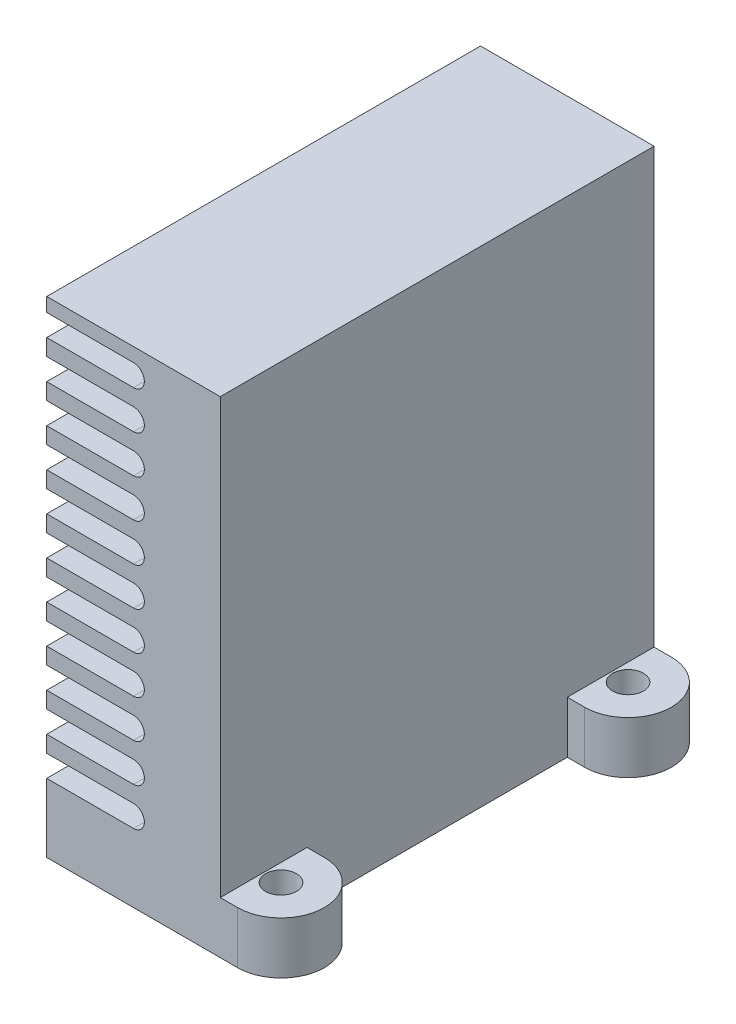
ISO-10303-21;
HEADER;
FILE_DESCRIPTION(('STEP AP214'),'2;1');
FILE_NAME('part.step','',(''),(''),'','','');
FILE_SCHEMA(('AUTOMOTIVE_DESIGN { 1 0 10303 214 1 1 1 1 }'));
ENDSEC;
DATA;
#1=APPLICATION_CONTEXT('core data for automotive mechanical design processes');
#2=APPLICATION_PROTOCOL_DEFINITION('international standard','automotive_design',2000,#1);
#3=PRODUCT_CONTEXT('',#1,'mechanical');
#4=PRODUCT('Part','Part','',(#3));
#5=PRODUCT_RELATED_PRODUCT_CATEGORY('part','',(#4));
#6=PRODUCT_DEFINITION_FORMATION('','',#4);
#7=PRODUCT_DEFINITION_CONTEXT('part definition',#1,'design');
#8=PRODUCT_DEFINITION('design','',#6,#7);
#9=PRODUCT_DEFINITION_SHAPE('','',#8);
#10=(LENGTH_UNIT() NAMED_UNIT(*) SI_UNIT(.MILLI.,.METRE.));
#11=(NAMED_UNIT(*) PLANE_ANGLE_UNIT() SI_UNIT($,.RADIAN.));
#12=(NAMED_UNIT(*) SI_UNIT($,.STERADIAN.) SOLID_ANGLE_UNIT());
#13=UNCERTAINTY_MEASURE_WITH_UNIT(LENGTH_MEASURE(1.E-05),#10,'distance_accuracy_value','');
#14=(GEOMETRIC_REPRESENTATION_CONTEXT(3) GLOBAL_UNCERTAINTY_ASSIGNED_CONTEXT((#13)) GLOBAL_UNIT_ASSIGNED_CONTEXT((#10,
#11,#12)) REPRESENTATION_CONTEXT('',''));
#15=CARTESIAN_POINT('',(0.,0.,0.));
#16=DIRECTION('',(0.,0.,1.));
#17=DIRECTION('',(1.,0.,0.));
#18=AXIS2_PLACEMENT_3D('',#15,#16,#17);
#19=CARTESIAN_POINT('',(-12.7,0.,-15.875));
#20=DIRECTION('',(0.,-1.,0.));
#21=DIRECTION('',(0.,0.,-1.));
#22=AXIS2_PLACEMENT_3D('',#19,#20,#21);
#23=PLANE('',#22);
#24=CARTESIAN_POINT('',(-11.5341399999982,0.,-14.4427051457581));
#25=DIRECTION('',(0.,-1.,0.));
#26=DIRECTION('',(0.,0.,-1.));
#27=AXIS2_PLACEMENT_3D('',#24,#25,#26);
#28=CIRCLE('',#27,1.72719999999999);
#29=CARTESIAN_POINT('',(-10.5688673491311,0.,-15.875));
#30=VERTEX_POINT('',#29);
#31=CARTESIAN_POINT('',(-12.7,0.,-13.1683463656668));
#32=VERTEX_POINT('',#31);
#33=EDGE_CURVE('E11',#30,#32,#28,.T.);
#34=ORIENTED_EDGE('',*,*,#33,.F.);
#35=DIRECTION('',(1.,0.,0.));
#36=VECTOR('',#35,1.);
#37=CARTESIAN_POINT('',(-12.7,0.,-15.875));
#38=LINE('',#37,#36);
#39=CARTESIAN_POINT('',(1.27,0.,-15.875));
#40=VERTEX_POINT('',#39);
#41=EDGE_CURVE('E504',#30,#40,#38,.T.);
#42=ORIENTED_EDGE('',*,*,#41,.T.);
#43=CARTESIAN_POINT('',(1.27,0.,-12.7));
#44=DIRECTION('',(0.,-1.,0.));
#45=DIRECTION('',(0.,0.,-1.));
#46=AXIS2_PLACEMENT_3D('',#43,#44,#45);
#47=CIRCLE('',#46,3.175);
#48=CARTESIAN_POINT('',(1.27,0.,-9.525));
#49=VERTEX_POINT('',#48);
#50=EDGE_CURVE('E525',#40,#49,#47,.T.);
#51=ORIENTED_EDGE('',*,*,#50,.T.);
#52=DIRECTION('',(-1.,0.,0.));
#53=VECTOR('',#52,1.);
#54=CARTESIAN_POINT('',(0.,0.,-9.525));
#55=LINE('',#54,#53);
#56=CARTESIAN_POINT('',(0.,0.,-9.525));
#57=VERTEX_POINT('',#56);
#58=EDGE_CURVE('E580',#49,#57,#55,.T.);
#59=ORIENTED_EDGE('',*,*,#58,.T.);
#60=DIRECTION('',(0.,0.,1.));
#61=VECTOR('',#60,1.);
#62=CARTESIAN_POINT('',(0.,0.,-15.875));
#63=LINE('',#62,#61);
#64=CARTESIAN_POINT('',(0.,0.,9.525));
#65=VERTEX_POINT('',#64);
#66=EDGE_CURVE('E584',#57,#65,#63,.T.);
#67=ORIENTED_EDGE('',*,*,#66,.T.);
#68=DIRECTION('',(1.,0.,0.));
#69=VECTOR('',#68,1.);
#70=CARTESIAN_POINT('',(0.,0.,9.525));
#71=LINE('',#70,#69);
#72=CARTESIAN_POINT('',(1.27,0.,9.525));
#73=VERTEX_POINT('',#72);
#74=EDGE_CURVE('E605',#65,#73,#71,.T.);
#75=ORIENTED_EDGE('',*,*,#74,.T.);
#76=CARTESIAN_POINT('',(1.27,0.,12.7));
#77=DIRECTION('',(0.,-1.,0.));
#78=DIRECTION('',(0.,0.,1.));
#79=AXIS2_PLACEMENT_3D('',#76,#77,#78);
#80=CIRCLE('',#79,3.175);
#81=CARTESIAN_POINT('',(1.27,0.,15.875));
#82=VERTEX_POINT('',#81);
#83=EDGE_CURVE('E495',#73,#82,#80,.T.);
#84=ORIENTED_EDGE('',*,*,#83,.T.);
#85=DIRECTION('',(1.,0.,0.));
#86=VECTOR('',#85,1.);
#87=CARTESIAN_POINT('',(-12.7,0.,15.875));
#88=LINE('',#87,#86);
#89=CARTESIAN_POINT('',(-12.7,0.,15.875));
#90=VERTEX_POINT('',#89);
#91=EDGE_CURVE('E639',#90,#82,#88,.T.);
#92=ORIENTED_EDGE('',*,*,#91,.F.);
#93=DIRECTION('',(0.,0.,1.));
#94=VECTOR('',#93,1.);
#95=CARTESIAN_POINT('',(-12.7,0.,-15.875));
#96=LINE('',#95,#94);
#97=EDGE_CURVE('E530',#32,#90,#96,.T.);
#98=ORIENTED_EDGE('',*,*,#97,.F.);
#99=EDGE_LOOP('',(#34,#42,#51,#59,#67,#75,#84,#92,#98));
#100=FACE_BOUND('',#99,.T.);
#101=CARTESIAN_POINT('',(1.27,0.,-12.7));
#102=DIRECTION('',(0.,-1.,0.));
#103=DIRECTION('',(0.,0.,-1.));
#104=AXIS2_PLACEMENT_3D('',#101,#102,#103);
#105=CIRCLE('',#104,1.13029999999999);
#106=CARTESIAN_POINT('',(1.27,0.,-13.8303));
#107=VERTEX_POINT('',#106);
#108=EDGE_CURVE('E539',#107,#107,#105,.T.);
#109=ORIENTED_EDGE('',*,*,#108,.F.);
#110=EDGE_LOOP('',(#109));
#111=FACE_BOUND('',#110,.T.);
#112=CARTESIAN_POINT('',(1.27,0.,12.7));
#113=DIRECTION('',(0.,-1.,0.));
#114=DIRECTION('',(0.,0.,-1.));
#115=AXIS2_PLACEMENT_3D('',#112,#113,#114);
#116=CIRCLE('',#115,1.13029999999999);
#117=CARTESIAN_POINT('',(1.27,0.,11.5697));
#118=VERTEX_POINT('',#117);
#119=EDGE_CURVE('E543',#118,#118,#116,.T.);
#120=ORIENTED_EDGE('',*,*,#119,.F.);
#121=EDGE_LOOP('',(#120));
#122=FACE_BOUND('',#121,.T.);
#123=ADVANCED_FACE('F46',(#100,#111,#122),#23,.T.);
#124=CARTESIAN_POINT('',(-12.7,5.01649999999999,-15.875));
#125=DIRECTION('',(0.,-1.,0.));
#126=DIRECTION('',(0.,0.,-1.));
#127=AXIS2_PLACEMENT_3D('',#124,#125,#126);
#128=PLANE('',#127);
#129=DIRECTION('',(1.,0.,0.));
#130=VECTOR('',#129,1.);
#131=CARTESIAN_POINT('',(-12.7,5.01649999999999,-15.875));
#132=LINE('',#131,#130);
#133=CARTESIAN_POINT('',(-10.5688673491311,5.01649999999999,-15.875));
#134=VERTEX_POINT('',#133);
#135=CARTESIAN_POINT('',(-6.35,5.0165,-15.875));
#136=VERTEX_POINT('',#135);
#137=EDGE_CURVE('E501',#134,#136,#132,.T.);
#138=ORIENTED_EDGE('',*,*,#137,.F.);
#139=CARTESIAN_POINT('',(-11.5341399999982,5.01649999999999,-14.4427051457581));
#140=DIRECTION('',(0.,-1.,0.));
#141=DIRECTION('',(0.,0.,-1.));
#142=AXIS2_PLACEMENT_3D('',#139,#140,#141);
#143=CIRCLE('',#142,1.72719999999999);
#144=CARTESIAN_POINT('',(-12.7,5.01649999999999,-13.1683463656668));
#145=VERTEX_POINT('',#144);
#146=EDGE_CURVE('E487',#134,#145,#143,.T.);
#147=ORIENTED_EDGE('',*,*,#146,.T.);
#148=DIRECTION('',(0.,0.,1.));
#149=VECTOR('',#148,1.);
#150=CARTESIAN_POINT('',(-12.7,5.01649999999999,-15.875));
#151=LINE('',#150,#149);
#152=CARTESIAN_POINT('',(-12.7,5.01649999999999,15.875));
#153=VERTEX_POINT('',#152);
#154=EDGE_CURVE('E494',#145,#153,#151,.T.);
#155=ORIENTED_EDGE('',*,*,#154,.T.);
#156=DIRECTION('',(1.,0.,0.));
#157=VECTOR('',#156,1.);
#158=CARTESIAN_POINT('',(-12.7,5.01649999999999,15.875));
#159=LINE('',#158,#157);
#160=CARTESIAN_POINT('',(-6.35,5.0165,15.875));
#161=VERTEX_POINT('',#160);
#162=EDGE_CURVE('E522',#153,#161,#159,.T.);
#163=ORIENTED_EDGE('',*,*,#162,.T.);
#164=DIRECTION('',(0.,0.,1.));
#165=VECTOR('',#164,1.);
#166=CARTESIAN_POINT('',(-6.35,5.0165,-15.875));
#167=LINE('',#166,#165);
#168=EDGE_CURVE('E510',#136,#161,#167,.T.);
#169=ORIENTED_EDGE('',*,*,#168,.F.);
#170=EDGE_LOOP('',(#138,#147,#155,#163,#169));
#171=FACE_BOUND('',#170,.T.);
#172=ADVANCED_FACE('F508',(#171),#128,.F.);
#173=CARTESIAN_POINT('',(0.,0.,-15.875));
#174=DIRECTION('',(1.,0.,0.));
#175=DIRECTION('',(0.,0.,-1.));
#176=AXIS2_PLACEMENT_3D('',#173,#174,#175);
#177=PLANE('',#176);
#178=DIRECTION('',(0.,-1.,0.));
#179=VECTOR('',#178,1.);
#180=CARTESIAN_POINT('',(0.,3.81,-9.525));
#181=LINE('',#180,#179);
#182=CARTESIAN_POINT('',(0.,3.81,-9.525));
#183=VERTEX_POINT('',#182);
#184=EDGE_CURVE('E549',#183,#57,#181,.T.);
#185=ORIENTED_EDGE('',*,*,#184,.F.);
#186=DIRECTION('',(0.,0.,-1.));
#187=VECTOR('',#186,1.);
#188=CARTESIAN_POINT('',(0.,3.81,-15.875));
#189=LINE('',#188,#187);
#190=CARTESIAN_POINT('',(0.,3.81,-15.875));
#191=VERTEX_POINT('',#190);
#192=EDGE_CURVE('E566',#183,#191,#189,.T.);
#193=ORIENTED_EDGE('',*,*,#192,.T.);
#194=DIRECTION('',(0.,1.,0.));
#195=VECTOR('',#194,1.);
#196=CARTESIAN_POINT('',(0.,0.,-15.875));
#197=LINE('',#196,#195);
#198=CARTESIAN_POINT('',(0.,35.56,-15.875));
#199=VERTEX_POINT('',#198);
#200=EDGE_CURVE('E570',#191,#199,#197,.T.);
#201=ORIENTED_EDGE('',*,*,#200,.T.);
#202=DIRECTION('',(0.,0.,1.));
#203=VECTOR('',#202,1.);
#204=CARTESIAN_POINT('',(0.,35.56,-15.875));
#205=LINE('',#204,#203);
#206=CARTESIAN_POINT('',(0.,35.56,15.875));
#207=VERTEX_POINT('',#206);
#208=EDGE_CURVE('E647',#199,#207,#205,.T.);
#209=ORIENTED_EDGE('',*,*,#208,.T.);
#210=DIRECTION('',(0.,1.,0.));
#211=VECTOR('',#210,1.);
#212=CARTESIAN_POINT('',(0.,0.,15.875));
#213=LINE('',#212,#211);
#214=CARTESIAN_POINT('',(0.,3.81,15.875));
#215=VERTEX_POINT('',#214);
#216=EDGE_CURVE('E627',#215,#207,#213,.T.);
#217=ORIENTED_EDGE('',*,*,#216,.F.);
#218=DIRECTION('',(0.,0.,-1.));
#219=VECTOR('',#218,1.);
#220=CARTESIAN_POINT('',(0.,3.81,15.875));
#221=LINE('',#220,#219);
#222=CARTESIAN_POINT('',(0.,3.81,9.525));
#223=VERTEX_POINT('',#222);
#224=EDGE_CURVE('E620',#215,#223,#221,.T.);
#225=ORIENTED_EDGE('',*,*,#224,.T.);
#226=DIRECTION('',(0.,-1.,0.));
#227=VECTOR('',#226,1.);
#228=CARTESIAN_POINT('',(0.,3.81,9.525));
#229=LINE('',#228,#227);
#230=EDGE_CURVE('E614',#223,#65,#229,.T.);
#231=ORIENTED_EDGE('',*,*,#230,.T.);
#232=ORIENTED_EDGE('',*,*,#66,.F.);
#233=EDGE_LOOP('',(#185,#193,#201,#209,#217,#225,#231,#232));
#234=FACE_BOUND('',#233,.T.);
#235=ADVANCED_FACE('F1110',(#234),#177,.T.);
#236=CARTESIAN_POINT('',(-12.7,35.56,-15.875));
#237=DIRECTION('',(-1.,0.,0.));
#238=DIRECTION('',(0.,-1.,0.));
#239=AXIS2_PLACEMENT_3D('',#236,#237,#238);
#240=PLANE('',#239);
#241=DIRECTION('',(0.,0.,1.));
#242=VECTOR('',#241,1.);
#243=CARTESIAN_POINT('',(-12.7,6.60399999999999,-15.875));
#244=LINE('',#243,#242);
#245=CARTESIAN_POINT('',(-12.7,6.60399999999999,-15.875));
#246=VERTEX_POINT('',#245);
#247=CARTESIAN_POINT('',(-12.7,6.60399999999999,15.875));
#248=VERTEX_POINT('',#247);
#249=EDGE_CURVE('E619',#246,#248,#244,.T.);
#250=ORIENTED_EDGE('',*,*,#249,.T.);
#251=DIRECTION('',(0.,-1.,0.));
#252=VECTOR('',#251,1.);
#253=CARTESIAN_POINT('',(-12.7,35.56,15.875));
#254=LINE('',#253,#252);
#255=CARTESIAN_POINT('',(-12.7,7.81049999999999,15.875));
#256=VERTEX_POINT('',#255);
#257=EDGE_CURVE('E662',#256,#248,#254,.T.);
#258=ORIENTED_EDGE('',*,*,#257,.F.);
#259=DIRECTION('',(0.,0.,1.));
#260=VECTOR('',#259,1.);
#261=CARTESIAN_POINT('',(-12.7,7.81049999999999,-15.875));
#262=LINE('',#261,#260);
#263=CARTESIAN_POINT('',(-12.7,7.81049999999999,-15.875));
#264=VERTEX_POINT('',#263);
#265=EDGE_CURVE('E972',#264,#256,#262,.T.);
#266=ORIENTED_EDGE('',*,*,#265,.F.);
#267=DIRECTION('',(0.,-1.,0.));
#268=VECTOR('',#267,1.);
#269=CARTESIAN_POINT('',(-12.7,35.56,-15.875));
#270=LINE('',#269,#268);
#271=EDGE_CURVE('E533',#264,#246,#270,.T.);
#272=ORIENTED_EDGE('',*,*,#271,.T.);
#273=EDGE_LOOP('',(#250,#258,#266,#272));
#274=FACE_BOUND('',#273,.T.);
#275=ADVANCED_FACE('F1030',(#274),#240,.T.);
#276=DIRECTION('',(0.,0.,1.));
#277=VECTOR('',#276,1.);
#278=CARTESIAN_POINT('',(-12.7,9.39799999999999,-15.875));
#279=LINE('',#278,#277);
#280=CARTESIAN_POINT('',(-12.7,9.39799999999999,-15.875));
#281=VERTEX_POINT('',#280);
#282=CARTESIAN_POINT('',(-12.7,9.39799999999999,15.875));
#283=VERTEX_POINT('',#282);
#284=EDGE_CURVE('E984',#281,#283,#279,.T.);
#285=ORIENTED_EDGE('',*,*,#284,.T.);
#286=CARTESIAN_POINT('',(-12.7,10.6045,15.875));
#287=VERTEX_POINT('',#286);
#288=EDGE_CURVE('E1143',#287,#283,#254,.T.);
#289=ORIENTED_EDGE('',*,*,#288,.F.);
#290=DIRECTION('',(0.,0.,1.));
#291=VECTOR('',#290,1.);
#292=CARTESIAN_POINT('',(-12.7,10.6045,-15.875));
#293=LINE('',#292,#291);
#294=CARTESIAN_POINT('',(-12.7,10.6045,-15.875));
#295=VERTEX_POINT('',#294);
#296=EDGE_CURVE('E935',#295,#287,#293,.T.);
#297=ORIENTED_EDGE('',*,*,#296,.F.);
#298=EDGE_CURVE('E951',#295,#281,#270,.T.);
#299=ORIENTED_EDGE('',*,*,#298,.T.);
#300=EDGE_LOOP('',(#285,#289,#297,#299));
#301=FACE_BOUND('',#300,.T.);
#302=ADVANCED_FACE('F1240',(#301),#240,.T.);
#303=DIRECTION('',(0.,0.,1.));
#304=VECTOR('',#303,1.);
#305=CARTESIAN_POINT('',(-12.7,12.192,-15.875));
#306=LINE('',#305,#304);
#307=CARTESIAN_POINT('',(-12.7,12.192,-15.875));
#308=VERTEX_POINT('',#307);
#309=CARTESIAN_POINT('',(-12.7,12.192,15.875));
#310=VERTEX_POINT('',#309);
#311=EDGE_CURVE('E947',#308,#310,#306,.T.);
#312=ORIENTED_EDGE('',*,*,#311,.T.);
#313=CARTESIAN_POINT('',(-12.7,13.3985,15.875));
#314=VERTEX_POINT('',#313);
#315=EDGE_CURVE('E1147',#314,#310,#254,.T.);
#316=ORIENTED_EDGE('',*,*,#315,.F.);
#317=DIRECTION('',(0.,0.,1.));
#318=VECTOR('',#317,1.);
#319=CARTESIAN_POINT('',(-12.7,13.3985,-15.875));
#320=LINE('',#319,#318);
#321=CARTESIAN_POINT('',(-12.7,13.3985,-15.875));
#322=VERTEX_POINT('',#321);
#323=EDGE_CURVE('E898',#322,#314,#320,.T.);
#324=ORIENTED_EDGE('',*,*,#323,.F.);
#325=EDGE_CURVE('E914',#322,#308,#270,.T.);
#326=ORIENTED_EDGE('',*,*,#325,.T.);
#327=EDGE_LOOP('',(#312,#316,#324,#326));
#328=FACE_BOUND('',#327,.T.);
#329=ADVANCED_FACE('F1231',(#328),#240,.T.);
#330=DIRECTION('',(0.,0.,1.));
#331=VECTOR('',#330,1.);
#332=CARTESIAN_POINT('',(-12.7,14.986,-15.875));
#333=LINE('',#332,#331);
#334=CARTESIAN_POINT('',(-12.7,14.986,-15.875));
#335=VERTEX_POINT('',#334);
#336=CARTESIAN_POINT('',(-12.7,14.986,15.875));
#337=VERTEX_POINT('',#336);
#338=EDGE_CURVE('E910',#335,#337,#333,.T.);
#339=ORIENTED_EDGE('',*,*,#338,.T.);
#340=CARTESIAN_POINT('',(-12.7,16.1925,15.875));
#341=VERTEX_POINT('',#340);
#342=EDGE_CURVE('E1153',#341,#337,#254,.T.);
#343=ORIENTED_EDGE('',*,*,#342,.F.);
#344=DIRECTION('',(0.,0.,1.));
#345=VECTOR('',#344,1.);
#346=CARTESIAN_POINT('',(-12.7,16.1925,-15.875));
#347=LINE('',#346,#345);
#348=CARTESIAN_POINT('',(-12.7,16.1925,-15.875));
#349=VERTEX_POINT('',#348);
#350=EDGE_CURVE('E861',#349,#341,#347,.T.);
#351=ORIENTED_EDGE('',*,*,#350,.F.);
#352=EDGE_CURVE('E877',#349,#335,#270,.T.);
#353=ORIENTED_EDGE('',*,*,#352,.T.);
#354=EDGE_LOOP('',(#339,#343,#351,#353));
#355=FACE_BOUND('',#354,.T.);
#356=ADVANCED_FACE('F1222',(#355),#240,.T.);
#357=DIRECTION('',(0.,0.,1.));
#358=VECTOR('',#357,1.);
#359=CARTESIAN_POINT('',(-12.7,17.78,-15.875));
#360=LINE('',#359,#358);
#361=CARTESIAN_POINT('',(-12.7,17.78,-15.875));
#362=VERTEX_POINT('',#361);
#363=CARTESIAN_POINT('',(-12.7,17.78,15.875));
#364=VERTEX_POINT('',#363);
#365=EDGE_CURVE('E873',#362,#364,#360,.T.);
#366=ORIENTED_EDGE('',*,*,#365,.T.);
#367=CARTESIAN_POINT('',(-12.7,18.9865,15.875));
#368=VERTEX_POINT('',#367);
#369=EDGE_CURVE('E1159',#368,#364,#254,.T.);
#370=ORIENTED_EDGE('',*,*,#369,.F.);
#371=DIRECTION('',(0.,0.,1.));
#372=VECTOR('',#371,1.);
#373=CARTESIAN_POINT('',(-12.7,18.9865,-15.875));
#374=LINE('',#373,#372);
#375=CARTESIAN_POINT('',(-12.7,18.9865,-15.875));
#376=VERTEX_POINT('',#375);
#377=EDGE_CURVE('E824',#376,#368,#374,.T.);
#378=ORIENTED_EDGE('',*,*,#377,.F.);
#379=EDGE_CURVE('E840',#376,#362,#270,.T.);
#380=ORIENTED_EDGE('',*,*,#379,.T.);
#381=EDGE_LOOP('',(#366,#370,#378,#380));
#382=FACE_BOUND('',#381,.T.);
#383=ADVANCED_FACE('F1213',(#382),#240,.T.);
#384=DIRECTION('',(0.,0.,1.));
#385=VECTOR('',#384,1.);
#386=CARTESIAN_POINT('',(-12.7,20.574,-15.875));
#387=LINE('',#386,#385);
#388=CARTESIAN_POINT('',(-12.7,20.574,-15.875));
#389=VERTEX_POINT('',#388);
#390=CARTESIAN_POINT('',(-12.7,20.574,15.875));
#391=VERTEX_POINT('',#390);
#392=EDGE_CURVE('E836',#389,#391,#387,.T.);
#393=ORIENTED_EDGE('',*,*,#392,.T.);
#394=CARTESIAN_POINT('',(-12.7,21.7805,15.875));
#395=VERTEX_POINT('',#394);
#396=EDGE_CURVE('E1165',#395,#391,#254,.T.);
#397=ORIENTED_EDGE('',*,*,#396,.F.);
#398=DIRECTION('',(0.,0.,1.));
#399=VECTOR('',#398,1.);
#400=CARTESIAN_POINT('',(-12.7,21.7805,-15.875));
#401=LINE('',#400,#399);
#402=CARTESIAN_POINT('',(-12.7,21.7805,-15.875));
#403=VERTEX_POINT('',#402);
#404=EDGE_CURVE('E787',#403,#395,#401,.T.);
#405=ORIENTED_EDGE('',*,*,#404,.F.);
#406=EDGE_CURVE('E803',#403,#389,#270,.T.);
#407=ORIENTED_EDGE('',*,*,#406,.T.);
#408=EDGE_LOOP('',(#393,#397,#405,#407));
#409=FACE_BOUND('',#408,.T.);
#410=ADVANCED_FACE('F1204',(#409),#240,.T.);
#411=DIRECTION('',(0.,0.,1.));
#412=VECTOR('',#411,1.);
#413=CARTESIAN_POINT('',(-12.7,23.368,-15.875));
#414=LINE('',#413,#412);
#415=CARTESIAN_POINT('',(-12.7,23.368,-15.875));
#416=VERTEX_POINT('',#415);
#417=CARTESIAN_POINT('',(-12.7,23.368,15.875));
#418=VERTEX_POINT('',#417);
#419=EDGE_CURVE('E799',#416,#418,#414,.T.);
#420=ORIENTED_EDGE('',*,*,#419,.T.);
#421=CARTESIAN_POINT('',(-12.7,24.5745,15.875));
#422=VERTEX_POINT('',#421);
#423=EDGE_CURVE('E1171',#422,#418,#254,.T.);
#424=ORIENTED_EDGE('',*,*,#423,.F.);
#425=DIRECTION('',(0.,0.,1.));
#426=VECTOR('',#425,1.);
#427=CARTESIAN_POINT('',(-12.7,24.5745,-15.875));
#428=LINE('',#427,#426);
#429=CARTESIAN_POINT('',(-12.7,24.5745,-15.875));
#430=VERTEX_POINT('',#429);
#431=EDGE_CURVE('E751',#430,#422,#428,.T.);
#432=ORIENTED_EDGE('',*,*,#431,.F.);
#433=EDGE_CURVE('E767',#430,#416,#270,.T.);
#434=ORIENTED_EDGE('',*,*,#433,.T.);
#435=EDGE_LOOP('',(#420,#424,#432,#434));
#436=FACE_BOUND('',#435,.T.);
#437=ADVANCED_FACE('F1195',(#436),#240,.T.);
#438=DIRECTION('',(0.,0.,1.));
#439=VECTOR('',#438,1.);
#440=CARTESIAN_POINT('',(-12.7,26.162,-15.875));
#441=LINE('',#440,#439);
#442=CARTESIAN_POINT('',(-12.7,26.162,-15.875));
#443=VERTEX_POINT('',#442);
#444=CARTESIAN_POINT('',(-12.7,26.162,15.875));
#445=VERTEX_POINT('',#444);
#446=EDGE_CURVE('E763',#443,#445,#441,.T.);
#447=ORIENTED_EDGE('',*,*,#446,.T.);
#448=CARTESIAN_POINT('',(-12.7,27.3685,15.875));
#449=VERTEX_POINT('',#448);
#450=EDGE_CURVE('E1100',#449,#445,#254,.T.);
#451=ORIENTED_EDGE('',*,*,#450,.F.);
#452=DIRECTION('',(0.,0.,1.));
#453=VECTOR('',#452,1.);
#454=CARTESIAN_POINT('',(-12.7,27.3685,-15.875));
#455=LINE('',#454,#453);
#456=CARTESIAN_POINT('',(-12.7,27.3685,-15.875));
#457=VERTEX_POINT('',#456);
#458=EDGE_CURVE('E715',#457,#449,#455,.T.);
#459=ORIENTED_EDGE('',*,*,#458,.F.);
#460=EDGE_CURVE('E731',#457,#443,#270,.T.);
#461=ORIENTED_EDGE('',*,*,#460,.T.);
#462=EDGE_LOOP('',(#447,#451,#459,#461));
#463=FACE_BOUND('',#462,.T.);
#464=ADVANCED_FACE('F1187',(#463),#240,.T.);
#465=DIRECTION('',(0.,0.,1.));
#466=VECTOR('',#465,1.);
#467=CARTESIAN_POINT('',(-12.7,28.956,-15.875));
#468=LINE('',#467,#466);
#469=CARTESIAN_POINT('',(-12.7,28.956,-15.875));
#470=VERTEX_POINT('',#469);
#471=CARTESIAN_POINT('',(-12.7,28.956,15.875));
#472=VERTEX_POINT('',#471);
#473=EDGE_CURVE('E727',#470,#472,#468,.T.);
#474=ORIENTED_EDGE('',*,*,#473,.T.);
#475=CARTESIAN_POINT('',(-12.7,30.1625,15.875));
#476=VERTEX_POINT('',#475);
#477=EDGE_CURVE('E1097',#476,#472,#254,.T.);
#478=ORIENTED_EDGE('',*,*,#477,.F.);
#479=DIRECTION('',(0.,0.,1.));
#480=VECTOR('',#479,1.);
#481=CARTESIAN_POINT('',(-12.7,30.1625,-15.875));
#482=LINE('',#481,#480);
#483=CARTESIAN_POINT('',(-12.7,30.1625,-15.875));
#484=VERTEX_POINT('',#483);
#485=EDGE_CURVE('E679',#484,#476,#482,.T.);
#486=ORIENTED_EDGE('',*,*,#485,.F.);
#487=EDGE_CURVE('E694',#484,#470,#270,.T.);
#488=ORIENTED_EDGE('',*,*,#487,.T.);
#489=EDGE_LOOP('',(#474,#478,#486,#488));
#490=FACE_BOUND('',#489,.T.);
#491=ADVANCED_FACE('F1418',(#490),#240,.T.);
#492=DIRECTION('',(0.,0.,1.));
#493=VECTOR('',#492,1.);
#494=CARTESIAN_POINT('',(-12.7,31.75,-15.875));
#495=LINE('',#494,#493);
#496=CARTESIAN_POINT('',(-12.7,31.75,-15.875));
#497=VERTEX_POINT('',#496);
#498=CARTESIAN_POINT('',(-12.7,31.75,15.875));
#499=VERTEX_POINT('',#498);
#500=EDGE_CURVE('E691',#497,#499,#495,.T.);
#501=ORIENTED_EDGE('',*,*,#500,.T.);
#502=CARTESIAN_POINT('',(-12.7,32.9565,15.875));
#503=VERTEX_POINT('',#502);
#504=EDGE_CURVE('E1095',#503,#499,#254,.T.);
#505=ORIENTED_EDGE('',*,*,#504,.F.);
#506=DIRECTION('',(0.,0.,1.));
#507=VECTOR('',#506,1.);
#508=CARTESIAN_POINT('',(-12.7,32.9565,-15.875));
#509=LINE('',#508,#507);
#510=CARTESIAN_POINT('',(-12.7,32.9565,-15.875));
#511=VERTEX_POINT('',#510);
#512=EDGE_CURVE('E648',#511,#503,#509,.T.);
#513=ORIENTED_EDGE('',*,*,#512,.F.);
#514=EDGE_CURVE('E532',#511,#497,#270,.T.);
#515=ORIENTED_EDGE('',*,*,#514,.T.);
#516=EDGE_LOOP('',(#501,#505,#513,#515));
#517=FACE_BOUND('',#516,.T.);
#518=ADVANCED_FACE('F1081',(#517),#240,.T.);
#519=DIRECTION('',(0.,0.,1.));
#520=VECTOR('',#519,1.);
#521=CARTESIAN_POINT('',(-12.7,34.544,-15.875));
#522=LINE('',#521,#520);
#523=CARTESIAN_POINT('',(-12.7,34.544,-15.875));
#524=VERTEX_POINT('',#523);
#525=CARTESIAN_POINT('',(-12.7,34.544,15.875));
#526=VERTEX_POINT('',#525);
#527=EDGE_CURVE('E531',#524,#526,#522,.T.);
#528=ORIENTED_EDGE('',*,*,#527,.T.);
#529=CARTESIAN_POINT('',(-12.7,35.56,15.875));
#530=VERTEX_POINT('',#529);
#531=EDGE_CURVE('E1098',#530,#526,#254,.T.);
#532=ORIENTED_EDGE('',*,*,#531,.F.);
#533=DIRECTION('',(0.,0.,1.));
#534=VECTOR('',#533,1.);
#535=CARTESIAN_POINT('',(-12.7,35.56,-15.875));
#536=LINE('',#535,#534);
#537=CARTESIAN_POINT('',(-12.7,35.56,-15.875));
#538=VERTEX_POINT('',#537);
#539=EDGE_CURVE('E506',#538,#530,#536,.T.);
#540=ORIENTED_EDGE('',*,*,#539,.F.);
#541=EDGE_CURVE('E526',#538,#524,#270,.T.);
#542=ORIENTED_EDGE('',*,*,#541,.T.);
#543=EDGE_LOOP('',(#528,#532,#540,#542));
#544=FACE_BOUND('',#543,.T.);
#545=ADVANCED_FACE('F1271',(#544),#240,.T.);
#546=DIRECTION('',(0.,-1.,0.));
#547=VECTOR('',#546,1.);
#548=CARTESIAN_POINT('',(-12.7,0.,-13.1683463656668));
#549=LINE('',#548,#547);
#550=EDGE_CURVE('E56',#32,#145,#549,.F.);
#551=ORIENTED_EDGE('',*,*,#550,.F.);
#552=ORIENTED_EDGE('',*,*,#97,.T.);
#553=EDGE_CURVE('E587',#153,#90,#254,.T.);
#554=ORIENTED_EDGE('',*,*,#553,.F.);
#555=ORIENTED_EDGE('',*,*,#154,.F.);
#556=EDGE_LOOP('',(#551,#552,#554,#555));
#557=FACE_BOUND('',#556,.T.);
#558=ADVANCED_FACE('F1267',(#557),#240,.T.);
#559=CARTESIAN_POINT('',(0.,35.56,-15.875));
#560=DIRECTION('',(0.,1.,0.));
#561=DIRECTION('',(0.,0.,1.));
#562=AXIS2_PLACEMENT_3D('',#559,#560,#561);
#563=PLANE('',#562);
#564=DIRECTION('',(-1.,0.,0.));
#565=VECTOR('',#564,1.);
#566=CARTESIAN_POINT('',(0.,35.56,15.875));
#567=LINE('',#566,#565);
#568=EDGE_CURVE('E631',#207,#530,#567,.T.);
#569=ORIENTED_EDGE('',*,*,#568,.F.);
#570=ORIENTED_EDGE('',*,*,#208,.F.);
#571=DIRECTION('',(-1.,0.,0.));
#572=VECTOR('',#571,1.);
#573=CARTESIAN_POINT('',(0.,35.56,-15.875));
#574=LINE('',#573,#572);
#575=EDGE_CURVE('E535',#199,#538,#574,.T.);
#576=ORIENTED_EDGE('',*,*,#575,.T.);
#577=ORIENTED_EDGE('',*,*,#539,.T.);
#578=EDGE_LOOP('',(#569,#570,#576,#577));
#579=FACE_BOUND('',#578,.T.);
#580=ADVANCED_FACE('F1270',(#579),#563,.T.);
#581=CARTESIAN_POINT('',(0.,0.,-15.875));
#582=DIRECTION('',(0.,0.,1.));
#583=DIRECTION('',(1.,0.,0.));
#584=AXIS2_PLACEMENT_3D('',#581,#582,#583);
#585=PLANE('',#584);
#586=ORIENTED_EDGE('',*,*,#41,.F.);
#587=DIRECTION('',(0.,-1.,0.));
#588=VECTOR('',#587,1.);
#589=CARTESIAN_POINT('',(-10.5688673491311,0.,-15.875));
#590=LINE('',#589,#588);
#591=EDGE_CURVE('E489',#30,#134,#590,.F.);
#592=ORIENTED_EDGE('',*,*,#591,.T.);
#593=ORIENTED_EDGE('',*,*,#137,.T.);
#594=CARTESIAN_POINT('',(-6.35,5.81025,-15.875));
#595=DIRECTION('',(0.,0.,1.));
#596=DIRECTION('',(-1.,0.,0.));
#597=AXIS2_PLACEMENT_3D('',#594,#595,#596);
#598=CIRCLE('',#597,0.793749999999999);
#599=CARTESIAN_POINT('',(-6.35,6.60399999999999,-15.875));
#600=VERTEX_POINT('',#599);
#601=EDGE_CURVE('E513',#136,#600,#598,.T.);
#602=ORIENTED_EDGE('',*,*,#601,.T.);
#603=DIRECTION('',(-1.,0.,0.));
#604=VECTOR('',#603,1.);
#605=CARTESIAN_POINT('',(-12.7,6.60399999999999,-15.875));
#606=LINE('',#605,#604);
#607=EDGE_CURVE('E517',#600,#246,#606,.T.);
#608=ORIENTED_EDGE('',*,*,#607,.T.);
#609=ORIENTED_EDGE('',*,*,#271,.F.);
#610=DIRECTION('',(1.,0.,0.));
#611=VECTOR('',#610,1.);
#612=CARTESIAN_POINT('',(-12.7,7.81049999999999,-15.875));
#613=LINE('',#612,#611);
#614=CARTESIAN_POINT('',(-6.35,7.8105,-15.875));
#615=VERTEX_POINT('',#614);
#616=EDGE_CURVE('E1003',#264,#615,#613,.T.);
#617=ORIENTED_EDGE('',*,*,#616,.T.);
#618=CARTESIAN_POINT('',(-6.35,8.60424999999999,-15.875));
#619=DIRECTION('',(0.,0.,1.));
#620=DIRECTION('',(-1.,0.,0.));
#621=AXIS2_PLACEMENT_3D('',#618,#619,#620);
#622=CIRCLE('',#621,0.793749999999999);
#623=CARTESIAN_POINT('',(-6.35,9.39799999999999,-15.875));
#624=VERTEX_POINT('',#623);
#625=EDGE_CURVE('E999',#615,#624,#622,.T.);
#626=ORIENTED_EDGE('',*,*,#625,.T.);
#627=DIRECTION('',(-1.,0.,0.));
#628=VECTOR('',#627,1.);
#629=CARTESIAN_POINT('',(-12.7,9.39799999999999,-15.875));
#630=LINE('',#629,#628);
#631=EDGE_CURVE('E971',#624,#281,#630,.T.);
#632=ORIENTED_EDGE('',*,*,#631,.T.);
#633=ORIENTED_EDGE('',*,*,#298,.F.);
#634=DIRECTION('',(1.,0.,0.));
#635=VECTOR('',#634,1.);
#636=CARTESIAN_POINT('',(-12.7,10.6045,-15.875));
#637=LINE('',#636,#635);
#638=CARTESIAN_POINT('',(-6.35,10.6045,-15.875));
#639=VERTEX_POINT('',#638);
#640=EDGE_CURVE('E967',#295,#639,#637,.T.);
#641=ORIENTED_EDGE('',*,*,#640,.T.);
#642=CARTESIAN_POINT('',(-6.35,11.39825,-15.875));
#643=DIRECTION('',(0.,0.,1.));
#644=DIRECTION('',(-1.,0.,0.));
#645=AXIS2_PLACEMENT_3D('',#642,#643,#644);
#646=CIRCLE('',#645,0.793749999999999);
#647=CARTESIAN_POINT('',(-6.35,12.192,-15.875));
#648=VERTEX_POINT('',#647);
#649=EDGE_CURVE('E963',#639,#648,#646,.T.);
#650=ORIENTED_EDGE('',*,*,#649,.T.);
#651=DIRECTION('',(-1.,0.,0.));
#652=VECTOR('',#651,1.);
#653=CARTESIAN_POINT('',(-12.7,12.192,-15.875));
#654=LINE('',#653,#652);
#655=EDGE_CURVE('E934',#648,#308,#654,.T.);
#656=ORIENTED_EDGE('',*,*,#655,.T.);
#657=ORIENTED_EDGE('',*,*,#325,.F.);
#658=DIRECTION('',(1.,0.,0.));
#659=VECTOR('',#658,1.);
#660=CARTESIAN_POINT('',(-12.7,13.3985,-15.875));
#661=LINE('',#660,#659);
#662=CARTESIAN_POINT('',(-6.35,13.3985,-15.875));
#663=VERTEX_POINT('',#662);
#664=EDGE_CURVE('E930',#322,#663,#661,.T.);
#665=ORIENTED_EDGE('',*,*,#664,.T.);
#666=CARTESIAN_POINT('',(-6.35,14.19225,-15.875));
#667=DIRECTION('',(0.,0.,1.));
#668=DIRECTION('',(-1.,0.,0.));
#669=AXIS2_PLACEMENT_3D('',#666,#667,#668);
#670=CIRCLE('',#669,0.793749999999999);
#671=CARTESIAN_POINT('',(-6.35,14.986,-15.875));
#672=VERTEX_POINT('',#671);
#673=EDGE_CURVE('E926',#663,#672,#670,.T.);
#674=ORIENTED_EDGE('',*,*,#673,.T.);
#675=DIRECTION('',(-1.,0.,0.));
#676=VECTOR('',#675,1.);
#677=CARTESIAN_POINT('',(-12.7,14.986,-15.875));
#678=LINE('',#677,#676);
#679=EDGE_CURVE('E897',#672,#335,#678,.T.);
#680=ORIENTED_EDGE('',*,*,#679,.T.);
#681=ORIENTED_EDGE('',*,*,#352,.F.);
#682=DIRECTION('',(1.,0.,0.));
#683=VECTOR('',#682,1.);
#684=CARTESIAN_POINT('',(-12.7,16.1925,-15.875));
#685=LINE('',#684,#683);
#686=CARTESIAN_POINT('',(-6.35,16.1925,-15.875));
#687=VERTEX_POINT('',#686);
#688=EDGE_CURVE('E893',#349,#687,#685,.T.);
#689=ORIENTED_EDGE('',*,*,#688,.T.);
#690=CARTESIAN_POINT('',(-6.35,16.98625,-15.875));
#691=DIRECTION('',(0.,0.,1.));
#692=DIRECTION('',(-1.,0.,0.));
#693=AXIS2_PLACEMENT_3D('',#690,#691,#692);
#694=CIRCLE('',#693,0.793749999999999);
#695=CARTESIAN_POINT('',(-6.35,17.78,-15.875));
#696=VERTEX_POINT('',#695);
#697=EDGE_CURVE('E889',#687,#696,#694,.T.);
#698=ORIENTED_EDGE('',*,*,#697,.T.);
#699=DIRECTION('',(-1.,0.,0.));
#700=VECTOR('',#699,1.);
#701=CARTESIAN_POINT('',(-12.7,17.78,-15.875));
#702=LINE('',#701,#700);
#703=EDGE_CURVE('E860',#696,#362,#702,.T.);
#704=ORIENTED_EDGE('',*,*,#703,.T.);
#705=ORIENTED_EDGE('',*,*,#379,.F.);
#706=DIRECTION('',(1.,0.,0.));
#707=VECTOR('',#706,1.);
#708=CARTESIAN_POINT('',(-12.7,18.9865,-15.875));
#709=LINE('',#708,#707);
#710=CARTESIAN_POINT('',(-6.35,18.9865,-15.875));
#711=VERTEX_POINT('',#710);
#712=EDGE_CURVE('E856',#376,#711,#709,.T.);
#713=ORIENTED_EDGE('',*,*,#712,.T.);
#714=CARTESIAN_POINT('',(-6.35,19.78025,-15.875));
#715=DIRECTION('',(0.,0.,1.));
#716=DIRECTION('',(-1.,0.,0.));
#717=AXIS2_PLACEMENT_3D('',#714,#715,#716);
#718=CIRCLE('',#717,0.793749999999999);
#719=CARTESIAN_POINT('',(-6.35,20.574,-15.875));
#720=VERTEX_POINT('',#719);
#721=EDGE_CURVE('E852',#711,#720,#718,.T.);
#722=ORIENTED_EDGE('',*,*,#721,.T.);
#723=DIRECTION('',(-1.,0.,0.));
#724=VECTOR('',#723,1.);
#725=CARTESIAN_POINT('',(-12.7,20.574,-15.875));
#726=LINE('',#725,#724);
#727=EDGE_CURVE('E823',#720,#389,#726,.T.);
#728=ORIENTED_EDGE('',*,*,#727,.T.);
#729=ORIENTED_EDGE('',*,*,#406,.F.);
#730=DIRECTION('',(1.,0.,0.));
#731=VECTOR('',#730,1.);
#732=CARTESIAN_POINT('',(-12.7,21.7805,-15.875));
#733=LINE('',#732,#731);
#734=CARTESIAN_POINT('',(-6.35,21.7805,-15.875));
#735=VERTEX_POINT('',#734);
#736=EDGE_CURVE('E819',#403,#735,#733,.T.);
#737=ORIENTED_EDGE('',*,*,#736,.T.);
#738=CARTESIAN_POINT('',(-6.35,22.57425,-15.875));
#739=DIRECTION('',(0.,0.,1.));
#740=DIRECTION('',(-1.,0.,0.));
#741=AXIS2_PLACEMENT_3D('',#738,#739,#740);
#742=CIRCLE('',#741,0.793749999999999);
#743=CARTESIAN_POINT('',(-6.35,23.368,-15.875));
#744=VERTEX_POINT('',#743);
#745=EDGE_CURVE('E815',#735,#744,#742,.T.);
#746=ORIENTED_EDGE('',*,*,#745,.T.);
#747=DIRECTION('',(-1.,0.,0.));
#748=VECTOR('',#747,1.);
#749=CARTESIAN_POINT('',(-12.7,23.368,-15.875));
#750=LINE('',#749,#748);
#751=EDGE_CURVE('E786',#744,#416,#750,.T.);
#752=ORIENTED_EDGE('',*,*,#751,.T.);
#753=ORIENTED_EDGE('',*,*,#433,.F.);
#754=DIRECTION('',(1.,0.,0.));
#755=VECTOR('',#754,1.);
#756=CARTESIAN_POINT('',(-12.7,24.5745,-15.875));
#757=LINE('',#756,#755);
#758=CARTESIAN_POINT('',(-6.35,24.5745,-15.875));
#759=VERTEX_POINT('',#758);
#760=EDGE_CURVE('E782',#430,#759,#757,.T.);
#761=ORIENTED_EDGE('',*,*,#760,.T.);
#762=CARTESIAN_POINT('',(-6.35,25.36825,-15.875));
#763=DIRECTION('',(0.,0.,1.));
#764=DIRECTION('',(-1.,0.,0.));
#765=AXIS2_PLACEMENT_3D('',#762,#763,#764);
#766=CIRCLE('',#765,0.793749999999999);
#767=CARTESIAN_POINT('',(-6.35,26.162,-15.875));
#768=VERTEX_POINT('',#767);
#769=EDGE_CURVE('E778',#759,#768,#766,.T.);
#770=ORIENTED_EDGE('',*,*,#769,.T.);
#771=DIRECTION('',(-1.,0.,0.));
#772=VECTOR('',#771,1.);
#773=CARTESIAN_POINT('',(-12.7,26.162,-15.875));
#774=LINE('',#773,#772);
#775=EDGE_CURVE('E750',#768,#443,#774,.T.);
#776=ORIENTED_EDGE('',*,*,#775,.T.);
#777=ORIENTED_EDGE('',*,*,#460,.F.);
#778=DIRECTION('',(1.,0.,0.));
#779=VECTOR('',#778,1.);
#780=CARTESIAN_POINT('',(-12.7,27.3685,-15.875));
#781=LINE('',#780,#779);
#782=CARTESIAN_POINT('',(-6.35,27.3685,-15.875));
#783=VERTEX_POINT('',#782);
#784=EDGE_CURVE('E746',#457,#783,#781,.T.);
#785=ORIENTED_EDGE('',*,*,#784,.T.);
#786=CARTESIAN_POINT('',(-6.35,28.16225,-15.875));
#787=DIRECTION('',(0.,0.,1.));
#788=DIRECTION('',(-1.,0.,0.));
#789=AXIS2_PLACEMENT_3D('',#786,#787,#788);
#790=CIRCLE('',#789,0.793749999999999);
#791=CARTESIAN_POINT('',(-6.35,28.956,-15.875));
#792=VERTEX_POINT('',#791);
#793=EDGE_CURVE('E742',#783,#792,#790,.T.);
#794=ORIENTED_EDGE('',*,*,#793,.T.);
#795=DIRECTION('',(-1.,0.,0.));
#796=VECTOR('',#795,1.);
#797=CARTESIAN_POINT('',(-12.7,28.956,-15.875));
#798=LINE('',#797,#796);
#799=EDGE_CURVE('E714',#792,#470,#798,.T.);
#800=ORIENTED_EDGE('',*,*,#799,.T.);
#801=ORIENTED_EDGE('',*,*,#487,.F.);
#802=DIRECTION('',(1.,0.,0.));
#803=VECTOR('',#802,1.);
#804=CARTESIAN_POINT('',(-12.7,30.1625,-15.875));
#805=LINE('',#804,#803);
#806=CARTESIAN_POINT('',(-6.35,30.1625,-15.875));
#807=VERTEX_POINT('',#806);
#808=EDGE_CURVE('E710',#484,#807,#805,.T.);
#809=ORIENTED_EDGE('',*,*,#808,.T.);
#810=CARTESIAN_POINT('',(-6.35,30.95625,-15.875));
#811=DIRECTION('',(0.,0.,1.));
#812=DIRECTION('',(-1.,0.,0.));
#813=AXIS2_PLACEMENT_3D('',#810,#811,#812);
#814=CIRCLE('',#813,0.793749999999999);
#815=CARTESIAN_POINT('',(-6.35,31.75,-15.875));
#816=VERTEX_POINT('',#815);
#817=EDGE_CURVE('E706',#807,#816,#814,.T.);
#818=ORIENTED_EDGE('',*,*,#817,.T.);
#819=DIRECTION('',(-1.,0.,0.));
#820=VECTOR('',#819,1.);
#821=CARTESIAN_POINT('',(-12.7,31.75,-15.875));
#822=LINE('',#821,#820);
#823=EDGE_CURVE('E678',#816,#497,#822,.T.);
#824=ORIENTED_EDGE('',*,*,#823,.T.);
#825=ORIENTED_EDGE('',*,*,#514,.F.);
#826=DIRECTION('',(1.,0.,0.));
#827=VECTOR('',#826,1.);
#828=CARTESIAN_POINT('',(-12.7,32.9565,-15.875));
#829=LINE('',#828,#827);
#830=CARTESIAN_POINT('',(-6.35,32.9565,-15.875));
#831=VERTEX_POINT('',#830);
#832=EDGE_CURVE('E674',#511,#831,#829,.T.);
#833=ORIENTED_EDGE('',*,*,#832,.T.);
#834=CARTESIAN_POINT('',(-6.35,33.75025,-15.875));
#835=DIRECTION('',(0.,0.,1.));
#836=DIRECTION('',(-1.,0.,0.));
#837=AXIS2_PLACEMENT_3D('',#834,#835,#836);
#838=CIRCLE('',#837,0.793749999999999);
#839=CARTESIAN_POINT('',(-6.35,34.544,-15.875));
#840=VERTEX_POINT('',#839);
#841=EDGE_CURVE('E670',#831,#840,#838,.T.);
#842=ORIENTED_EDGE('',*,*,#841,.T.);
#843=DIRECTION('',(-1.,0.,0.));
#844=VECTOR('',#843,1.);
#845=CARTESIAN_POINT('',(-12.7,34.544,-15.875));
#846=LINE('',#845,#844);
#847=EDGE_CURVE('E576',#840,#524,#846,.T.);
#848=ORIENTED_EDGE('',*,*,#847,.T.);
#849=ORIENTED_EDGE('',*,*,#541,.F.);
#850=ORIENTED_EDGE('',*,*,#575,.F.);
#851=ORIENTED_EDGE('',*,*,#200,.F.);
#852=DIRECTION('',(1.,0.,0.));
#853=VECTOR('',#852,1.);
#854=CARTESIAN_POINT('',(0.,3.81,-15.875));
#855=LINE('',#854,#853);
#856=CARTESIAN_POINT('',(1.27,3.81,-15.875));
#857=VERTEX_POINT('',#856);
#858=EDGE_CURVE('E571',#191,#857,#855,.T.);
#859=ORIENTED_EDGE('',*,*,#858,.T.);
#860=DIRECTION('',(0.,-1.,0.));
#861=VECTOR('',#860,1.);
#862=CARTESIAN_POINT('',(1.27,3.81,-15.875));
#863=LINE('',#862,#861);
#864=EDGE_CURVE('E575',#857,#40,#863,.T.);
#865=ORIENTED_EDGE('',*,*,#864,.T.);
#866=EDGE_LOOP('',(#586,#592,#593,#602,#608,#609,#617,#626,#632,#633,#641,#650,#656,#657,#665,
#674,#680,#681,#689,#698,#704,#705,#713,#722,#728,#729,#737,#746,#752,#753,#761,#770,#776,#777,
#785,#794,#800,#801,#809,#818,#824,#825,#833,#842,#848,#849,#850,#851,#859,#865));
#867=FACE_BOUND('',#866,.T.);
#868=ADVANCED_FACE('F499',(#867),#585,.F.);
#869=CARTESIAN_POINT('',(0.,0.,15.875));
#870=DIRECTION('',(0.,0.,1.));
#871=DIRECTION('',(1.,0.,0.));
#872=AXIS2_PLACEMENT_3D('',#869,#870,#871);
#873=PLANE('',#872);
#874=DIRECTION('',(-1.,0.,0.));
#875=VECTOR('',#874,1.);
#876=CARTESIAN_POINT('',(-12.7,6.60399999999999,15.875));
#877=LINE('',#876,#875);
#878=CARTESIAN_POINT('',(-6.35,6.60399999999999,15.875));
#879=VERTEX_POINT('',#878);
#880=EDGE_CURVE('E975',#879,#248,#877,.T.);
#881=ORIENTED_EDGE('',*,*,#880,.F.);
#882=CARTESIAN_POINT('',(-6.35,5.81025,15.875));
#883=DIRECTION('',(0.,0.,1.));
#884=DIRECTION('',(-1.,0.,0.));
#885=AXIS2_PLACEMENT_3D('',#882,#883,#884);
#886=CIRCLE('',#885,0.793749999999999);
#887=EDGE_CURVE('E1009',#161,#879,#886,.T.);
#888=ORIENTED_EDGE('',*,*,#887,.F.);
#889=ORIENTED_EDGE('',*,*,#162,.F.);
#890=ORIENTED_EDGE('',*,*,#553,.T.);
#891=ORIENTED_EDGE('',*,*,#91,.T.);
#892=DIRECTION('',(0.,-1.,0.));
#893=VECTOR('',#892,1.);
#894=CARTESIAN_POINT('',(1.27,3.81,15.875));
#895=LINE('',#894,#893);
#896=CARTESIAN_POINT('',(1.27,3.81,15.875));
#897=VERTEX_POINT('',#896);
#898=EDGE_CURVE('E597',#897,#82,#895,.T.);
#899=ORIENTED_EDGE('',*,*,#898,.F.);
#900=DIRECTION('',(-1.,0.,0.));
#901=VECTOR('',#900,1.);
#902=CARTESIAN_POINT('',(0.,3.81,15.875));
#903=LINE('',#902,#901);
#904=EDGE_CURVE('E632',#897,#215,#903,.T.);
#905=ORIENTED_EDGE('',*,*,#904,.T.);
#906=ORIENTED_EDGE('',*,*,#216,.T.);
#907=ORIENTED_EDGE('',*,*,#568,.T.);
#908=ORIENTED_EDGE('',*,*,#531,.T.);
#909=DIRECTION('',(-1.,0.,0.));
#910=VECTOR('',#909,1.);
#911=CARTESIAN_POINT('',(-12.7,34.544,15.875));
#912=LINE('',#911,#910);
#913=CARTESIAN_POINT('',(-6.35,34.544,15.875));
#914=VERTEX_POINT('',#913);
#915=EDGE_CURVE('E658',#914,#526,#912,.T.);
#916=ORIENTED_EDGE('',*,*,#915,.F.);
#917=CARTESIAN_POINT('',(-6.35,33.75025,15.875));
#918=DIRECTION('',(0.,0.,1.));
#919=DIRECTION('',(-1.,0.,0.));
#920=AXIS2_PLACEMENT_3D('',#917,#918,#919);
#921=CIRCLE('',#920,0.793749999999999);
#922=CARTESIAN_POINT('',(-6.35,32.9565,15.875));
#923=VERTEX_POINT('',#922);
#924=EDGE_CURVE('E655',#923,#914,#921,.T.);
#925=ORIENTED_EDGE('',*,*,#924,.F.);
#926=DIRECTION('',(1.,0.,0.));
#927=VECTOR('',#926,1.);
#928=CARTESIAN_POINT('',(-12.7,32.9565,15.875));
#929=LINE('',#928,#927);
#930=EDGE_CURVE('E651',#503,#923,#929,.T.);
#931=ORIENTED_EDGE('',*,*,#930,.F.);
#932=ORIENTED_EDGE('',*,*,#504,.T.);
#933=DIRECTION('',(-1.,0.,0.));
#934=VECTOR('',#933,1.);
#935=CARTESIAN_POINT('',(-12.7,31.75,15.875));
#936=LINE('',#935,#934);
#937=CARTESIAN_POINT('',(-6.35,31.75,15.875));
#938=VERTEX_POINT('',#937);
#939=EDGE_CURVE('E650',#938,#499,#936,.T.);
#940=ORIENTED_EDGE('',*,*,#939,.F.);
#941=CARTESIAN_POINT('',(-6.35,30.95625,15.875));
#942=DIRECTION('',(0.,0.,1.));
#943=DIRECTION('',(-1.,0.,0.));
#944=AXIS2_PLACEMENT_3D('',#941,#942,#943);
#945=CIRCLE('',#944,0.793749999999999);
#946=CARTESIAN_POINT('',(-6.35,30.1625,15.875));
#947=VERTEX_POINT('',#946);
#948=EDGE_CURVE('E687',#947,#938,#945,.T.);
#949=ORIENTED_EDGE('',*,*,#948,.F.);
#950=DIRECTION('',(1.,0.,0.));
#951=VECTOR('',#950,1.);
#952=CARTESIAN_POINT('',(-12.7,30.1625,15.875));
#953=LINE('',#952,#951);
#954=EDGE_CURVE('E683',#476,#947,#953,.T.);
#955=ORIENTED_EDGE('',*,*,#954,.F.);
#956=ORIENTED_EDGE('',*,*,#477,.T.);
#957=DIRECTION('',(-1.,0.,0.));
#958=VECTOR('',#957,1.);
#959=CARTESIAN_POINT('',(-12.7,28.956,15.875));
#960=LINE('',#959,#958);
#961=CARTESIAN_POINT('',(-6.35,28.956,15.875));
#962=VERTEX_POINT('',#961);
#963=EDGE_CURVE('E682',#962,#472,#960,.T.);
#964=ORIENTED_EDGE('',*,*,#963,.F.);
#965=CARTESIAN_POINT('',(-6.35,28.16225,15.875));
#966=DIRECTION('',(0.,0.,1.));
#967=DIRECTION('',(-1.,0.,0.));
#968=AXIS2_PLACEMENT_3D('',#965,#966,#967);
#969=CIRCLE('',#968,0.793749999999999);
#970=CARTESIAN_POINT('',(-6.35,27.3685,15.875));
#971=VERTEX_POINT('',#970);
#972=EDGE_CURVE('E723',#971,#962,#969,.T.);
#973=ORIENTED_EDGE('',*,*,#972,.F.);
#974=DIRECTION('',(1.,0.,0.));
#975=VECTOR('',#974,1.);
#976=CARTESIAN_POINT('',(-12.7,27.3685,15.875));
#977=LINE('',#976,#975);
#978=EDGE_CURVE('E719',#449,#971,#977,.T.);
#979=ORIENTED_EDGE('',*,*,#978,.F.);
#980=ORIENTED_EDGE('',*,*,#450,.T.);
#981=DIRECTION('',(-1.,0.,0.));
#982=VECTOR('',#981,1.);
#983=CARTESIAN_POINT('',(-12.7,26.162,15.875));
#984=LINE('',#983,#982);
#985=CARTESIAN_POINT('',(-6.35,26.162,15.875));
#986=VERTEX_POINT('',#985);
#987=EDGE_CURVE('E718',#986,#445,#984,.T.);
#988=ORIENTED_EDGE('',*,*,#987,.F.);
#989=CARTESIAN_POINT('',(-6.35,25.36825,15.875));
#990=DIRECTION('',(0.,0.,1.));
#991=DIRECTION('',(-1.,0.,0.));
#992=AXIS2_PLACEMENT_3D('',#989,#990,#991);
#993=CIRCLE('',#992,0.793749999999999);
#994=CARTESIAN_POINT('',(-6.35,24.5745,15.875));
#995=VERTEX_POINT('',#994);
#996=EDGE_CURVE('E759',#995,#986,#993,.T.);
#997=ORIENTED_EDGE('',*,*,#996,.F.);
#998=DIRECTION('',(1.,0.,0.));
#999=VECTOR('',#998,1.);
#1000=CARTESIAN_POINT('',(-12.7,24.5745,15.875));
#1001=LINE('',#1000,#999);
#1002=EDGE_CURVE('E755',#422,#995,#1001,.T.);
#1003=ORIENTED_EDGE('',*,*,#1002,.F.);
#1004=ORIENTED_EDGE('',*,*,#423,.T.);
#1005=DIRECTION('',(-1.,0.,0.));
#1006=VECTOR('',#1005,1.);
#1007=CARTESIAN_POINT('',(-12.7,23.368,15.875));
#1008=LINE('',#1007,#1006);
#1009=CARTESIAN_POINT('',(-6.35,23.368,15.875));
#1010=VERTEX_POINT('',#1009);
#1011=EDGE_CURVE('E754',#1010,#418,#1008,.T.);
#1012=ORIENTED_EDGE('',*,*,#1011,.F.);
#1013=CARTESIAN_POINT('',(-6.35,22.57425,15.875));
#1014=DIRECTION('',(0.,0.,1.));
#1015=DIRECTION('',(-1.,0.,0.));
#1016=AXIS2_PLACEMENT_3D('',#1013,#1014,#1015);
#1017=CIRCLE('',#1016,0.793749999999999);
#1018=CARTESIAN_POINT('',(-6.35,21.7805,15.875));
#1019=VERTEX_POINT('',#1018);
#1020=EDGE_CURVE('E795',#1019,#1010,#1017,.T.);
#1021=ORIENTED_EDGE('',*,*,#1020,.F.);
#1022=DIRECTION('',(1.,0.,0.));
#1023=VECTOR('',#1022,1.);
#1024=CARTESIAN_POINT('',(-12.7,21.7805,15.875));
#1025=LINE('',#1024,#1023);
#1026=EDGE_CURVE('E791',#395,#1019,#1025,.T.);
#1027=ORIENTED_EDGE('',*,*,#1026,.F.);
#1028=ORIENTED_EDGE('',*,*,#396,.T.);
#1029=DIRECTION('',(-1.,0.,0.));
#1030=VECTOR('',#1029,1.);
#1031=CARTESIAN_POINT('',(-12.7,20.574,15.875));
#1032=LINE('',#1031,#1030);
#1033=CARTESIAN_POINT('',(-6.35,20.574,15.875));
#1034=VERTEX_POINT('',#1033);
#1035=EDGE_CURVE('E790',#1034,#391,#1032,.T.);
#1036=ORIENTED_EDGE('',*,*,#1035,.F.);
#1037=CARTESIAN_POINT('',(-6.35,19.78025,15.875));
#1038=DIRECTION('',(0.,0.,1.));
#1039=DIRECTION('',(-1.,0.,0.));
#1040=AXIS2_PLACEMENT_3D('',#1037,#1038,#1039);
#1041=CIRCLE('',#1040,0.793749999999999);
#1042=CARTESIAN_POINT('',(-6.35,18.9865,15.875));
#1043=VERTEX_POINT('',#1042);
#1044=EDGE_CURVE('E832',#1043,#1034,#1041,.T.);
#1045=ORIENTED_EDGE('',*,*,#1044,.F.);
#1046=DIRECTION('',(1.,0.,0.));
#1047=VECTOR('',#1046,1.);
#1048=CARTESIAN_POINT('',(-12.7,18.9865,15.875));
#1049=LINE('',#1048,#1047);
#1050=EDGE_CURVE('E828',#368,#1043,#1049,.T.);
#1051=ORIENTED_EDGE('',*,*,#1050,.F.);
#1052=ORIENTED_EDGE('',*,*,#369,.T.);
#1053=DIRECTION('',(-1.,0.,0.));
#1054=VECTOR('',#1053,1.);
#1055=CARTESIAN_POINT('',(-12.7,17.78,15.875));
#1056=LINE('',#1055,#1054);
#1057=CARTESIAN_POINT('',(-6.35,17.78,15.875));
#1058=VERTEX_POINT('',#1057);
#1059=EDGE_CURVE('E827',#1058,#364,#1056,.T.);
#1060=ORIENTED_EDGE('',*,*,#1059,.F.);
#1061=CARTESIAN_POINT('',(-6.35,16.98625,15.875));
#1062=DIRECTION('',(0.,0.,1.));
#1063=DIRECTION('',(-1.,0.,0.));
#1064=AXIS2_PLACEMENT_3D('',#1061,#1062,#1063);
#1065=CIRCLE('',#1064,0.793749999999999);
#1066=CARTESIAN_POINT('',(-6.35,16.1925,15.875));
#1067=VERTEX_POINT('',#1066);
#1068=EDGE_CURVE('E869',#1067,#1058,#1065,.T.);
#1069=ORIENTED_EDGE('',*,*,#1068,.F.);
#1070=DIRECTION('',(1.,0.,0.));
#1071=VECTOR('',#1070,1.);
#1072=CARTESIAN_POINT('',(-12.7,16.1925,15.875));
#1073=LINE('',#1072,#1071);
#1074=EDGE_CURVE('E865',#341,#1067,#1073,.T.);
#1075=ORIENTED_EDGE('',*,*,#1074,.F.);
#1076=ORIENTED_EDGE('',*,*,#342,.T.);
#1077=DIRECTION('',(-1.,0.,0.));
#1078=VECTOR('',#1077,1.);
#1079=CARTESIAN_POINT('',(-12.7,14.986,15.875));
#1080=LINE('',#1079,#1078);
#1081=CARTESIAN_POINT('',(-6.35,14.986,15.875));
#1082=VERTEX_POINT('',#1081);
#1083=EDGE_CURVE('E864',#1082,#337,#1080,.T.);
#1084=ORIENTED_EDGE('',*,*,#1083,.F.);
#1085=CARTESIAN_POINT('',(-6.35,14.19225,15.875));
#1086=DIRECTION('',(0.,0.,1.));
#1087=DIRECTION('',(-1.,0.,0.));
#1088=AXIS2_PLACEMENT_3D('',#1085,#1086,#1087);
#1089=CIRCLE('',#1088,0.793749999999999);
#1090=CARTESIAN_POINT('',(-6.35,13.3985,15.875));
#1091=VERTEX_POINT('',#1090);
#1092=EDGE_CURVE('E906',#1091,#1082,#1089,.T.);
#1093=ORIENTED_EDGE('',*,*,#1092,.F.);
#1094=DIRECTION('',(1.,0.,0.));
#1095=VECTOR('',#1094,1.);
#1096=CARTESIAN_POINT('',(-12.7,13.3985,15.875));
#1097=LINE('',#1096,#1095);
#1098=EDGE_CURVE('E902',#314,#1091,#1097,.T.);
#1099=ORIENTED_EDGE('',*,*,#1098,.F.);
#1100=ORIENTED_EDGE('',*,*,#315,.T.);
#1101=DIRECTION('',(-1.,0.,0.));
#1102=VECTOR('',#1101,1.);
#1103=CARTESIAN_POINT('',(-12.7,12.192,15.875));
#1104=LINE('',#1103,#1102);
#1105=CARTESIAN_POINT('',(-6.35,12.192,15.875));
#1106=VERTEX_POINT('',#1105);
#1107=EDGE_CURVE('E901',#1106,#310,#1104,.T.);
#1108=ORIENTED_EDGE('',*,*,#1107,.F.);
#1109=CARTESIAN_POINT('',(-6.35,11.39825,15.875));
#1110=DIRECTION('',(0.,0.,1.));
#1111=DIRECTION('',(-1.,0.,0.));
#1112=AXIS2_PLACEMENT_3D('',#1109,#1110,#1111);
#1113=CIRCLE('',#1112,0.793749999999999);
#1114=CARTESIAN_POINT('',(-6.35,10.6045,15.875));
#1115=VERTEX_POINT('',#1114);
#1116=EDGE_CURVE('E943',#1115,#1106,#1113,.T.);
#1117=ORIENTED_EDGE('',*,*,#1116,.F.);
#1118=DIRECTION('',(1.,0.,0.));
#1119=VECTOR('',#1118,1.);
#1120=CARTESIAN_POINT('',(-12.7,10.6045,15.875));
#1121=LINE('',#1120,#1119);
#1122=EDGE_CURVE('E939',#287,#1115,#1121,.T.);
#1123=ORIENTED_EDGE('',*,*,#1122,.F.);
#1124=ORIENTED_EDGE('',*,*,#288,.T.);
#1125=DIRECTION('',(-1.,0.,0.));
#1126=VECTOR('',#1125,1.);
#1127=CARTESIAN_POINT('',(-12.7,9.39799999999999,15.875));
#1128=LINE('',#1127,#1126);
#1129=CARTESIAN_POINT('',(-6.35,9.39799999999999,15.875));
#1130=VERTEX_POINT('',#1129);
#1131=EDGE_CURVE('E938',#1130,#283,#1128,.T.);
#1132=ORIENTED_EDGE('',*,*,#1131,.F.);
#1133=CARTESIAN_POINT('',(-6.35,8.60424999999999,15.875));
#1134=DIRECTION('',(0.,0.,1.));
#1135=DIRECTION('',(-1.,0.,0.));
#1136=AXIS2_PLACEMENT_3D('',#1133,#1134,#1135);
#1137=CIRCLE('',#1136,0.793749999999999);
#1138=CARTESIAN_POINT('',(-6.35,7.8105,15.875));
#1139=VERTEX_POINT('',#1138);
#1140=EDGE_CURVE('E980',#1139,#1130,#1137,.T.);
#1141=ORIENTED_EDGE('',*,*,#1140,.F.);
#1142=DIRECTION('',(1.,0.,0.));
#1143=VECTOR('',#1142,1.);
#1144=CARTESIAN_POINT('',(-12.7,7.81049999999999,15.875));
#1145=LINE('',#1144,#1143);
#1146=EDGE_CURVE('E976',#256,#1139,#1145,.T.);
#1147=ORIENTED_EDGE('',*,*,#1146,.F.);
#1148=ORIENTED_EDGE('',*,*,#257,.T.);
#1149=EDGE_LOOP('',(#881,#888,#889,#890,#891,#899,#905,#906,#907,#908,#916,#925,#931,#932,#940,
#949,#955,#956,#964,#973,#979,#980,#988,#997,#1003,#1004,#1012,#1021,#1027,#1028,#1036,#1045,
#1051,#1052,#1060,#1069,#1075,#1076,#1084,#1093,#1099,#1100,#1108,#1117,#1123,#1124,#1132,#1141,
#1147,#1148));
#1150=FACE_BOUND('',#1149,.T.);
#1151=ADVANCED_FACE('F1092',(#1150),#873,.T.);
#1152=CARTESIAN_POINT('',(-12.7,34.544,-15.875));
#1153=DIRECTION('',(0.,1.,0.));
#1154=DIRECTION('',(0.,0.,1.));
#1155=AXIS2_PLACEMENT_3D('',#1152,#1153,#1154);
#1156=PLANE('',#1155);
#1157=ORIENTED_EDGE('',*,*,#915,.T.);
#1158=ORIENTED_EDGE('',*,*,#527,.F.);
#1159=ORIENTED_EDGE('',*,*,#847,.F.);
#1160=DIRECTION('',(0.,0.,1.));
#1161=VECTOR('',#1160,1.);
#1162=CARTESIAN_POINT('',(-6.35,34.544,-15.875));
#1163=LINE('',#1162,#1161);
#1164=EDGE_CURVE('E656',#840,#914,#1163,.T.);
#1165=ORIENTED_EDGE('',*,*,#1164,.T.);
#1166=EDGE_LOOP('',(#1157,#1158,#1159,#1165));
#1167=FACE_BOUND('',#1166,.T.);
#1168=ADVANCED_FACE('F1377',(#1167),#1156,.F.);
#1169=CARTESIAN_POINT('',(-6.35,33.75025,-15.875));
#1170=DIRECTION('',(0.,0.,1.));
#1171=DIRECTION('',(1.,0.,0.));
#1172=AXIS2_PLACEMENT_3D('',#1169,#1170,#1171);
#1173=CYLINDRICAL_SURFACE('',#1172,0.793749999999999);
#1174=ORIENTED_EDGE('',*,*,#924,.T.);
#1175=ORIENTED_EDGE('',*,*,#1164,.F.);
#1176=ORIENTED_EDGE('',*,*,#841,.F.);
#1177=DIRECTION('',(0.,0.,1.));
#1178=VECTOR('',#1177,1.);
#1179=CARTESIAN_POINT('',(-6.35,32.9565,-15.875));
#1180=LINE('',#1179,#1178);
#1181=EDGE_CURVE('E652',#831,#923,#1180,.T.);
#1182=ORIENTED_EDGE('',*,*,#1181,.T.);
#1183=EDGE_LOOP('',(#1174,#1175,#1176,#1182));
#1184=FACE_BOUND('',#1183,.T.);
#1185=ADVANCED_FACE('F1380',(#1184),#1173,.F.);
#1186=CARTESIAN_POINT('',(-12.7,32.9565,-15.875));
#1187=DIRECTION('',(0.,-1.,0.));
#1188=DIRECTION('',(0.,0.,-1.));
#1189=AXIS2_PLACEMENT_3D('',#1186,#1187,#1188);
#1190=PLANE('',#1189);
#1191=ORIENTED_EDGE('',*,*,#930,.T.);
#1192=ORIENTED_EDGE('',*,*,#1181,.F.);
#1193=ORIENTED_EDGE('',*,*,#832,.F.);
#1194=ORIENTED_EDGE('',*,*,#512,.T.);
#1195=EDGE_LOOP('',(#1191,#1192,#1193,#1194));
#1196=FACE_BOUND('',#1195,.T.);
#1197=ADVANCED_FACE('F1370',(#1196),#1190,.F.);
#1198=CARTESIAN_POINT('',(-12.7,31.75,-15.875));
#1199=DIRECTION('',(0.,1.,0.));
#1200=DIRECTION('',(0.,0.,1.));
#1201=AXIS2_PLACEMENT_3D('',#1198,#1199,#1200);
#1202=PLANE('',#1201);
#1203=ORIENTED_EDGE('',*,*,#939,.T.);
#1204=ORIENTED_EDGE('',*,*,#500,.F.);
#1205=ORIENTED_EDGE('',*,*,#823,.F.);
#1206=DIRECTION('',(0.,0.,1.));
#1207=VECTOR('',#1206,1.);
#1208=CARTESIAN_POINT('',(-6.35,31.75,-15.875));
#1209=LINE('',#1208,#1207);
#1210=EDGE_CURVE('E688',#816,#938,#1209,.T.);
#1211=ORIENTED_EDGE('',*,*,#1210,.T.);
#1212=EDGE_LOOP('',(#1203,#1204,#1205,#1211));
#1213=FACE_BOUND('',#1212,.T.);
#1214=ADVANCED_FACE('F1087',(#1213),#1202,.F.);
#1215=CARTESIAN_POINT('',(-6.35,30.95625,-15.875));
#1216=DIRECTION('',(0.,0.,1.));
#1217=DIRECTION('',(1.,0.,0.));
#1218=AXIS2_PLACEMENT_3D('',#1215,#1216,#1217);
#1219=CYLINDRICAL_SURFACE('',#1218,0.793749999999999);
#1220=ORIENTED_EDGE('',*,*,#948,.T.);
#1221=ORIENTED_EDGE('',*,*,#1210,.F.);
#1222=ORIENTED_EDGE('',*,*,#817,.F.);
#1223=DIRECTION('',(0.,0.,1.));
#1224=VECTOR('',#1223,1.);
#1225=CARTESIAN_POINT('',(-6.35,30.1625,-15.875));
#1226=LINE('',#1225,#1224);
#1227=EDGE_CURVE('E684',#807,#947,#1226,.T.);
#1228=ORIENTED_EDGE('',*,*,#1227,.T.);
#1229=EDGE_LOOP('',(#1220,#1221,#1222,#1228));
#1230=FACE_BOUND('',#1229,.T.);
#1231=ADVANCED_FACE('F1369',(#1230),#1219,.F.);
#1232=CARTESIAN_POINT('',(-12.7,30.1625,-15.875));
#1233=DIRECTION('',(0.,-1.,0.));
#1234=DIRECTION('',(0.,0.,-1.));
#1235=AXIS2_PLACEMENT_3D('',#1232,#1233,#1234);
#1236=PLANE('',#1235);
#1237=ORIENTED_EDGE('',*,*,#954,.T.);
#1238=ORIENTED_EDGE('',*,*,#1227,.F.);
#1239=ORIENTED_EDGE('',*,*,#808,.F.);
#1240=ORIENTED_EDGE('',*,*,#485,.T.);
#1241=EDGE_LOOP('',(#1237,#1238,#1239,#1240));
#1242=FACE_BOUND('',#1241,.T.);
#1243=ADVANCED_FACE('F1359',(#1242),#1236,.F.);
#1244=CARTESIAN_POINT('',(-12.7,28.956,-15.875));
#1245=DIRECTION('',(0.,1.,0.));
#1246=DIRECTION('',(0.,0.,1.));
#1247=AXIS2_PLACEMENT_3D('',#1244,#1245,#1246);
#1248=PLANE('',#1247);
#1249=ORIENTED_EDGE('',*,*,#963,.T.);
#1250=ORIENTED_EDGE('',*,*,#473,.F.);
#1251=ORIENTED_EDGE('',*,*,#799,.F.);
#1252=DIRECTION('',(0.,0.,1.));
#1253=VECTOR('',#1252,1.);
#1254=CARTESIAN_POINT('',(-6.35,28.956,-15.875));
#1255=LINE('',#1254,#1253);
#1256=EDGE_CURVE('E724',#792,#962,#1255,.T.);
#1257=ORIENTED_EDGE('',*,*,#1256,.T.);
#1258=EDGE_LOOP('',(#1249,#1250,#1251,#1257));
#1259=FACE_BOUND('',#1258,.T.);
#1260=ADVANCED_FACE('F1355',(#1259),#1248,.F.);
#1261=CARTESIAN_POINT('',(-6.35,28.16225,-15.875));
#1262=DIRECTION('',(0.,0.,1.));
#1263=DIRECTION('',(1.,0.,0.));
#1264=AXIS2_PLACEMENT_3D('',#1261,#1262,#1263);
#1265=CYLINDRICAL_SURFACE('',#1264,0.793749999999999);
#1266=ORIENTED_EDGE('',*,*,#972,.T.);
#1267=ORIENTED_EDGE('',*,*,#1256,.F.);
#1268=ORIENTED_EDGE('',*,*,#793,.F.);
#1269=DIRECTION('',(0.,0.,1.));
#1270=VECTOR('',#1269,1.);
#1271=CARTESIAN_POINT('',(-6.35,27.3685,-15.875));
#1272=LINE('',#1271,#1270);
#1273=EDGE_CURVE('E720',#783,#971,#1272,.T.);
#1274=ORIENTED_EDGE('',*,*,#1273,.T.);
#1275=EDGE_LOOP('',(#1266,#1267,#1268,#1274));
#1276=FACE_BOUND('',#1275,.T.);
#1277=ADVANCED_FACE('F1358',(#1276),#1265,.F.);
#1278=CARTESIAN_POINT('',(-12.7,27.3685,-15.875));
#1279=DIRECTION('',(0.,-1.,0.));
#1280=DIRECTION('',(0.,0.,-1.));
#1281=AXIS2_PLACEMENT_3D('',#1278,#1279,#1280);
#1282=PLANE('',#1281);
#1283=ORIENTED_EDGE('',*,*,#978,.T.);
#1284=ORIENTED_EDGE('',*,*,#1273,.F.);
#1285=ORIENTED_EDGE('',*,*,#784,.F.);
#1286=ORIENTED_EDGE('',*,*,#458,.T.);
#1287=EDGE_LOOP('',(#1283,#1284,#1285,#1286));
#1288=FACE_BOUND('',#1287,.T.);
#1289=ADVANCED_FACE('F1350',(#1288),#1282,.F.);
#1290=CARTESIAN_POINT('',(-12.7,26.162,-15.875));
#1291=DIRECTION('',(0.,1.,0.));
#1292=DIRECTION('',(0.,0.,1.));
#1293=AXIS2_PLACEMENT_3D('',#1290,#1291,#1292);
#1294=PLANE('',#1293);
#1295=ORIENTED_EDGE('',*,*,#987,.T.);
#1296=ORIENTED_EDGE('',*,*,#446,.F.);
#1297=ORIENTED_EDGE('',*,*,#775,.F.);
#1298=DIRECTION('',(0.,0.,1.));
#1299=VECTOR('',#1298,1.);
#1300=CARTESIAN_POINT('',(-6.35,26.162,-15.875));
#1301=LINE('',#1300,#1299);
#1302=EDGE_CURVE('E760',#768,#986,#1301,.T.);
#1303=ORIENTED_EDGE('',*,*,#1302,.T.);
#1304=EDGE_LOOP('',(#1295,#1296,#1297,#1303));
#1305=FACE_BOUND('',#1304,.T.);
#1306=ADVANCED_FACE('F1190',(#1305),#1294,.F.);
#1307=CARTESIAN_POINT('',(-6.35,25.36825,-15.875));
#1308=DIRECTION('',(0.,0.,1.));
#1309=DIRECTION('',(1.,0.,0.));
#1310=AXIS2_PLACEMENT_3D('',#1307,#1308,#1309);
#1311=CYLINDRICAL_SURFACE('',#1310,0.793749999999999);
#1312=ORIENTED_EDGE('',*,*,#996,.T.);
#1313=ORIENTED_EDGE('',*,*,#1302,.F.);
#1314=ORIENTED_EDGE('',*,*,#769,.F.);
#1315=DIRECTION('',(0.,0.,1.));
#1316=VECTOR('',#1315,1.);
#1317=CARTESIAN_POINT('',(-6.35,24.5745,-15.875));
#1318=LINE('',#1317,#1316);
#1319=EDGE_CURVE('E756',#759,#995,#1318,.T.);
#1320=ORIENTED_EDGE('',*,*,#1319,.T.);
#1321=EDGE_LOOP('',(#1312,#1313,#1314,#1320));
#1322=FACE_BOUND('',#1321,.T.);
#1323=ADVANCED_FACE('F1193',(#1322),#1311,.F.);
#1324=CARTESIAN_POINT('',(-12.7,24.5745,-15.875));
#1325=DIRECTION('',(0.,-1.,0.));
#1326=DIRECTION('',(0.,0.,-1.));
#1327=AXIS2_PLACEMENT_3D('',#1324,#1325,#1326);
#1328=PLANE('',#1327);
#1329=ORIENTED_EDGE('',*,*,#1002,.T.);
#1330=ORIENTED_EDGE('',*,*,#1319,.F.);
#1331=ORIENTED_EDGE('',*,*,#760,.F.);
#1332=ORIENTED_EDGE('',*,*,#431,.T.);
#1333=EDGE_LOOP('',(#1329,#1330,#1331,#1332));
#1334=FACE_BOUND('',#1333,.T.);
#1335=ADVANCED_FACE('F1343',(#1334),#1328,.F.);
#1336=CARTESIAN_POINT('',(-12.7,23.368,-15.875));
#1337=DIRECTION('',(0.,1.,0.));
#1338=DIRECTION('',(0.,0.,1.));
#1339=AXIS2_PLACEMENT_3D('',#1336,#1337,#1338);
#1340=PLANE('',#1339);
#1341=ORIENTED_EDGE('',*,*,#1011,.T.);
#1342=ORIENTED_EDGE('',*,*,#419,.F.);
#1343=ORIENTED_EDGE('',*,*,#751,.F.);
#1344=DIRECTION('',(0.,0.,1.));
#1345=VECTOR('',#1344,1.);
#1346=CARTESIAN_POINT('',(-6.35,23.368,-15.875));
#1347=LINE('',#1346,#1345);
#1348=EDGE_CURVE('E796',#744,#1010,#1347,.T.);
#1349=ORIENTED_EDGE('',*,*,#1348,.T.);
#1350=EDGE_LOOP('',(#1341,#1342,#1343,#1349));
#1351=FACE_BOUND('',#1350,.T.);
#1352=ADVANCED_FACE('F1198',(#1351),#1340,.F.);
#1353=CARTESIAN_POINT('',(-6.35,22.57425,-15.875));
#1354=DIRECTION('',(0.,0.,1.));
#1355=DIRECTION('',(1.,0.,0.));
#1356=AXIS2_PLACEMENT_3D('',#1353,#1354,#1355);
#1357=CYLINDRICAL_SURFACE('',#1356,0.793749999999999);
#1358=ORIENTED_EDGE('',*,*,#1020,.T.);
#1359=ORIENTED_EDGE('',*,*,#1348,.F.);
#1360=ORIENTED_EDGE('',*,*,#745,.F.);
#1361=DIRECTION('',(0.,0.,1.));
#1362=VECTOR('',#1361,1.);
#1363=CARTESIAN_POINT('',(-6.35,21.7805,-15.875));
#1364=LINE('',#1363,#1362);
#1365=EDGE_CURVE('E792',#735,#1019,#1364,.T.);
#1366=ORIENTED_EDGE('',*,*,#1365,.T.);
#1367=EDGE_LOOP('',(#1358,#1359,#1360,#1366));
#1368=FACE_BOUND('',#1367,.T.);
#1369=ADVANCED_FACE('F1201',(#1368),#1357,.F.);
#1370=CARTESIAN_POINT('',(-12.7,21.7805,-15.875));
#1371=DIRECTION('',(0.,-1.,0.));
#1372=DIRECTION('',(0.,0.,-1.));
#1373=AXIS2_PLACEMENT_3D('',#1370,#1371,#1372);
#1374=PLANE('',#1373);
#1375=ORIENTED_EDGE('',*,*,#1026,.T.);
#1376=ORIENTED_EDGE('',*,*,#1365,.F.);
#1377=ORIENTED_EDGE('',*,*,#736,.F.);
#1378=ORIENTED_EDGE('',*,*,#404,.T.);
#1379=EDGE_LOOP('',(#1375,#1376,#1377,#1378));
#1380=FACE_BOUND('',#1379,.T.);
#1381=ADVANCED_FACE('F1336',(#1380),#1374,.F.);
#1382=CARTESIAN_POINT('',(-12.7,20.574,-15.875));
#1383=DIRECTION('',(0.,1.,0.));
#1384=DIRECTION('',(0.,0.,1.));
#1385=AXIS2_PLACEMENT_3D('',#1382,#1383,#1384);
#1386=PLANE('',#1385);
#1387=ORIENTED_EDGE('',*,*,#1035,.T.);
#1388=ORIENTED_EDGE('',*,*,#392,.F.);
#1389=ORIENTED_EDGE('',*,*,#727,.F.);
#1390=DIRECTION('',(0.,0.,1.));
#1391=VECTOR('',#1390,1.);
#1392=CARTESIAN_POINT('',(-6.35,20.574,-15.875));
#1393=LINE('',#1392,#1391);
#1394=EDGE_CURVE('E833',#720,#1034,#1393,.T.);
#1395=ORIENTED_EDGE('',*,*,#1394,.T.);
#1396=EDGE_LOOP('',(#1387,#1388,#1389,#1395));
#1397=FACE_BOUND('',#1396,.T.);
#1398=ADVANCED_FACE('F1207',(#1397),#1386,.F.);
#1399=CARTESIAN_POINT('',(-6.35,19.78025,-15.875));
#1400=DIRECTION('',(0.,0.,1.));
#1401=DIRECTION('',(1.,0.,0.));
#1402=AXIS2_PLACEMENT_3D('',#1399,#1400,#1401);
#1403=CYLINDRICAL_SURFACE('',#1402,0.793749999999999);
#1404=ORIENTED_EDGE('',*,*,#1044,.T.);
#1405=ORIENTED_EDGE('',*,*,#1394,.F.);
#1406=ORIENTED_EDGE('',*,*,#721,.F.);
#1407=DIRECTION('',(0.,0.,1.));
#1408=VECTOR('',#1407,1.);
#1409=CARTESIAN_POINT('',(-6.35,18.9865,-15.875));
#1410=LINE('',#1409,#1408);
#1411=EDGE_CURVE('E829',#711,#1043,#1410,.T.);
#1412=ORIENTED_EDGE('',*,*,#1411,.T.);
#1413=EDGE_LOOP('',(#1404,#1405,#1406,#1412));
#1414=FACE_BOUND('',#1413,.T.);
#1415=ADVANCED_FACE('F1210',(#1414),#1403,.F.);
#1416=CARTESIAN_POINT('',(-12.7,18.9865,-15.875));
#1417=DIRECTION('',(0.,-1.,0.));
#1418=DIRECTION('',(0.,0.,-1.));
#1419=AXIS2_PLACEMENT_3D('',#1416,#1417,#1418);
#1420=PLANE('',#1419);
#1421=ORIENTED_EDGE('',*,*,#1050,.T.);
#1422=ORIENTED_EDGE('',*,*,#1411,.F.);
#1423=ORIENTED_EDGE('',*,*,#712,.F.);
#1424=ORIENTED_EDGE('',*,*,#377,.T.);
#1425=EDGE_LOOP('',(#1421,#1422,#1423,#1424));
#1426=FACE_BOUND('',#1425,.T.);
#1427=ADVANCED_FACE('F1328',(#1426),#1420,.F.);
#1428=CARTESIAN_POINT('',(-12.7,17.78,-15.875));
#1429=DIRECTION('',(0.,1.,0.));
#1430=DIRECTION('',(0.,0.,1.));
#1431=AXIS2_PLACEMENT_3D('',#1428,#1429,#1430);
#1432=PLANE('',#1431);
#1433=ORIENTED_EDGE('',*,*,#1059,.T.);
#1434=ORIENTED_EDGE('',*,*,#365,.F.);
#1435=ORIENTED_EDGE('',*,*,#703,.F.);
#1436=DIRECTION('',(0.,0.,1.));
#1437=VECTOR('',#1436,1.);
#1438=CARTESIAN_POINT('',(-6.35,17.78,-15.875));
#1439=LINE('',#1438,#1437);
#1440=EDGE_CURVE('E870',#696,#1058,#1439,.T.);
#1441=ORIENTED_EDGE('',*,*,#1440,.T.);
#1442=EDGE_LOOP('',(#1433,#1434,#1435,#1441));
#1443=FACE_BOUND('',#1442,.T.);
#1444=ADVANCED_FACE('F1216',(#1443),#1432,.F.);
#1445=CARTESIAN_POINT('',(-6.35,16.98625,-15.875));
#1446=DIRECTION('',(0.,0.,1.));
#1447=DIRECTION('',(1.,0.,0.));
#1448=AXIS2_PLACEMENT_3D('',#1445,#1446,#1447);
#1449=CYLINDRICAL_SURFACE('',#1448,0.793749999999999);
#1450=ORIENTED_EDGE('',*,*,#1068,.T.);
#1451=ORIENTED_EDGE('',*,*,#1440,.F.);
#1452=ORIENTED_EDGE('',*,*,#697,.F.);
#1453=DIRECTION('',(0.,0.,1.));
#1454=VECTOR('',#1453,1.);
#1455=CARTESIAN_POINT('',(-6.35,16.1925,-15.875));
#1456=LINE('',#1455,#1454);
#1457=EDGE_CURVE('E866',#687,#1067,#1456,.T.);
#1458=ORIENTED_EDGE('',*,*,#1457,.T.);
#1459=EDGE_LOOP('',(#1450,#1451,#1452,#1458));
#1460=FACE_BOUND('',#1459,.T.);
#1461=ADVANCED_FACE('F1219',(#1460),#1449,.F.);
#1462=CARTESIAN_POINT('',(-12.7,16.1925,-15.875));
#1463=DIRECTION('',(0.,-1.,0.));
#1464=DIRECTION('',(0.,0.,-1.));
#1465=AXIS2_PLACEMENT_3D('',#1462,#1463,#1464);
#1466=PLANE('',#1465);
#1467=ORIENTED_EDGE('',*,*,#1074,.T.);
#1468=ORIENTED_EDGE('',*,*,#1457,.F.);
#1469=ORIENTED_EDGE('',*,*,#688,.F.);
#1470=ORIENTED_EDGE('',*,*,#350,.T.);
#1471=EDGE_LOOP('',(#1467,#1468,#1469,#1470));
#1472=FACE_BOUND('',#1471,.T.);
#1473=ADVANCED_FACE('F1331',(#1472),#1466,.F.);
#1474=CARTESIAN_POINT('',(-12.7,14.986,-15.875));
#1475=DIRECTION('',(0.,1.,0.));
#1476=DIRECTION('',(0.,0.,1.));
#1477=AXIS2_PLACEMENT_3D('',#1474,#1475,#1476);
#1478=PLANE('',#1477);
#1479=ORIENTED_EDGE('',*,*,#1083,.T.);
#1480=ORIENTED_EDGE('',*,*,#338,.F.);
#1481=ORIENTED_EDGE('',*,*,#679,.F.);
#1482=DIRECTION('',(0.,0.,1.));
#1483=VECTOR('',#1482,1.);
#1484=CARTESIAN_POINT('',(-6.35,14.986,-15.875));
#1485=LINE('',#1484,#1483);
#1486=EDGE_CURVE('E907',#672,#1082,#1485,.T.);
#1487=ORIENTED_EDGE('',*,*,#1486,.T.);
#1488=EDGE_LOOP('',(#1479,#1480,#1481,#1487));
#1489=FACE_BOUND('',#1488,.T.);
#1490=ADVANCED_FACE('F1225',(#1489),#1478,.F.);
#1491=CARTESIAN_POINT('',(-6.35,14.19225,-15.875));
#1492=DIRECTION('',(0.,0.,1.));
#1493=DIRECTION('',(1.,0.,0.));
#1494=AXIS2_PLACEMENT_3D('',#1491,#1492,#1493);
#1495=CYLINDRICAL_SURFACE('',#1494,0.793749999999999);
#1496=ORIENTED_EDGE('',*,*,#1092,.T.);
#1497=ORIENTED_EDGE('',*,*,#1486,.F.);
#1498=ORIENTED_EDGE('',*,*,#673,.F.);
#1499=DIRECTION('',(0.,0.,1.));
#1500=VECTOR('',#1499,1.);
#1501=CARTESIAN_POINT('',(-6.35,13.3985,-15.875));
#1502=LINE('',#1501,#1500);
#1503=EDGE_CURVE('E903',#663,#1091,#1502,.T.);
#1504=ORIENTED_EDGE('',*,*,#1503,.T.);
#1505=EDGE_LOOP('',(#1496,#1497,#1498,#1504));
#1506=FACE_BOUND('',#1505,.T.);
#1507=ADVANCED_FACE('F1228',(#1506),#1495,.F.);
#1508=CARTESIAN_POINT('',(-12.7,13.3985,-15.875));
#1509=DIRECTION('',(0.,-1.,0.));
#1510=DIRECTION('',(0.,0.,-1.));
#1511=AXIS2_PLACEMENT_3D('',#1508,#1509,#1510);
#1512=PLANE('',#1511);
#1513=ORIENTED_EDGE('',*,*,#1098,.T.);
#1514=ORIENTED_EDGE('',*,*,#1503,.F.);
#1515=ORIENTED_EDGE('',*,*,#664,.F.);
#1516=ORIENTED_EDGE('',*,*,#323,.T.);
#1517=EDGE_LOOP('',(#1513,#1514,#1515,#1516));
#1518=FACE_BOUND('',#1517,.T.);
#1519=ADVANCED_FACE('F1317',(#1518),#1512,.F.);
#1520=CARTESIAN_POINT('',(-12.7,12.192,-15.875));
#1521=DIRECTION('',(0.,1.,0.));
#1522=DIRECTION('',(0.,0.,1.));
#1523=AXIS2_PLACEMENT_3D('',#1520,#1521,#1522);
#1524=PLANE('',#1523);
#1525=ORIENTED_EDGE('',*,*,#1107,.T.);
#1526=ORIENTED_EDGE('',*,*,#311,.F.);
#1527=ORIENTED_EDGE('',*,*,#655,.F.);
#1528=DIRECTION('',(0.,0.,1.));
#1529=VECTOR('',#1528,1.);
#1530=CARTESIAN_POINT('',(-6.35,12.192,-15.875));
#1531=LINE('',#1530,#1529);
#1532=EDGE_CURVE('E944',#648,#1106,#1531,.T.);
#1533=ORIENTED_EDGE('',*,*,#1532,.T.);
#1534=EDGE_LOOP('',(#1525,#1526,#1527,#1533));
#1535=FACE_BOUND('',#1534,.T.);
#1536=ADVANCED_FACE('F1234',(#1535),#1524,.F.);
#1537=CARTESIAN_POINT('',(-6.35,11.39825,-15.875));
#1538=DIRECTION('',(0.,0.,1.));
#1539=DIRECTION('',(1.,0.,0.));
#1540=AXIS2_PLACEMENT_3D('',#1537,#1538,#1539);
#1541=CYLINDRICAL_SURFACE('',#1540,0.793749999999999);
#1542=ORIENTED_EDGE('',*,*,#1116,.T.);
#1543=ORIENTED_EDGE('',*,*,#1532,.F.);
#1544=ORIENTED_EDGE('',*,*,#649,.F.);
#1545=DIRECTION('',(0.,0.,1.));
#1546=VECTOR('',#1545,1.);
#1547=CARTESIAN_POINT('',(-6.35,10.6045,-15.875));
#1548=LINE('',#1547,#1546);
#1549=EDGE_CURVE('E940',#639,#1115,#1548,.T.);
#1550=ORIENTED_EDGE('',*,*,#1549,.T.);
#1551=EDGE_LOOP('',(#1542,#1543,#1544,#1550));
#1552=FACE_BOUND('',#1551,.T.);
#1553=ADVANCED_FACE('F1237',(#1552),#1541,.F.);
#1554=CARTESIAN_POINT('',(-12.7,10.6045,-15.875));
#1555=DIRECTION('',(0.,-1.,0.));
#1556=DIRECTION('',(0.,0.,-1.));
#1557=AXIS2_PLACEMENT_3D('',#1554,#1555,#1556);
#1558=PLANE('',#1557);
#1559=ORIENTED_EDGE('',*,*,#1122,.T.);
#1560=ORIENTED_EDGE('',*,*,#1549,.F.);
#1561=ORIENTED_EDGE('',*,*,#640,.F.);
#1562=ORIENTED_EDGE('',*,*,#296,.T.);
#1563=EDGE_LOOP('',(#1559,#1560,#1561,#1562));
#1564=FACE_BOUND('',#1563,.T.);
#1565=ADVANCED_FACE('F1305',(#1564),#1558,.F.);
#1566=CARTESIAN_POINT('',(-12.7,9.39799999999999,-15.875));
#1567=DIRECTION('',(0.,1.,0.));
#1568=DIRECTION('',(0.,0.,1.));
#1569=AXIS2_PLACEMENT_3D('',#1566,#1567,#1568);
#1570=PLANE('',#1569);
#1571=ORIENTED_EDGE('',*,*,#1131,.T.);
#1572=ORIENTED_EDGE('',*,*,#284,.F.);
#1573=ORIENTED_EDGE('',*,*,#631,.F.);
#1574=DIRECTION('',(0.,0.,1.));
#1575=VECTOR('',#1574,1.);
#1576=CARTESIAN_POINT('',(-6.35,9.39799999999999,-15.875));
#1577=LINE('',#1576,#1575);
#1578=EDGE_CURVE('E981',#624,#1130,#1577,.T.);
#1579=ORIENTED_EDGE('',*,*,#1578,.T.);
#1580=EDGE_LOOP('',(#1571,#1572,#1573,#1579));
#1581=FACE_BOUND('',#1580,.T.);
#1582=ADVANCED_FACE('F1243',(#1581),#1570,.F.);
#1583=CARTESIAN_POINT('',(-6.35,8.60424999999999,-15.875));
#1584=DIRECTION('',(0.,0.,1.));
#1585=DIRECTION('',(1.,0.,0.));
#1586=AXIS2_PLACEMENT_3D('',#1583,#1584,#1585);
#1587=CYLINDRICAL_SURFACE('',#1586,0.793749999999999);
#1588=ORIENTED_EDGE('',*,*,#1140,.T.);
#1589=ORIENTED_EDGE('',*,*,#1578,.F.);
#1590=ORIENTED_EDGE('',*,*,#625,.F.);
#1591=DIRECTION('',(0.,0.,1.));
#1592=VECTOR('',#1591,1.);
#1593=CARTESIAN_POINT('',(-6.35,7.8105,-15.875));
#1594=LINE('',#1593,#1592);
#1595=EDGE_CURVE('E977',#615,#1139,#1594,.T.);
#1596=ORIENTED_EDGE('',*,*,#1595,.T.);
#1597=EDGE_LOOP('',(#1588,#1589,#1590,#1596));
#1598=FACE_BOUND('',#1597,.T.);
#1599=ADVANCED_FACE('F1246',(#1598),#1587,.F.);
#1600=CARTESIAN_POINT('',(-12.7,7.81049999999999,-15.875));
#1601=DIRECTION('',(0.,-1.,0.));
#1602=DIRECTION('',(0.,0.,-1.));
#1603=AXIS2_PLACEMENT_3D('',#1600,#1601,#1602);
#1604=PLANE('',#1603);
#1605=ORIENTED_EDGE('',*,*,#1146,.T.);
#1606=ORIENTED_EDGE('',*,*,#1595,.F.);
#1607=ORIENTED_EDGE('',*,*,#616,.F.);
#1608=ORIENTED_EDGE('',*,*,#265,.T.);
#1609=EDGE_LOOP('',(#1605,#1606,#1607,#1608));
#1610=FACE_BOUND('',#1609,.T.);
#1611=ADVANCED_FACE('F1249',(#1610),#1604,.F.);
#1612=CARTESIAN_POINT('',(-12.7,6.60399999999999,-15.875));
#1613=DIRECTION('',(0.,1.,0.));
#1614=DIRECTION('',(0.,0.,1.));
#1615=AXIS2_PLACEMENT_3D('',#1612,#1613,#1614);
#1616=PLANE('',#1615);
#1617=ORIENTED_EDGE('',*,*,#880,.T.);
#1618=ORIENTED_EDGE('',*,*,#249,.F.);
#1619=ORIENTED_EDGE('',*,*,#607,.F.);
#1620=DIRECTION('',(0.,0.,1.));
#1621=VECTOR('',#1620,1.);
#1622=CARTESIAN_POINT('',(-6.35,6.60399999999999,-15.875));
#1623=LINE('',#1622,#1621);
#1624=EDGE_CURVE('E1010',#600,#879,#1623,.T.);
#1625=ORIENTED_EDGE('',*,*,#1624,.T.);
#1626=EDGE_LOOP('',(#1617,#1618,#1619,#1625));
#1627=FACE_BOUND('',#1626,.T.);
#1628=ADVANCED_FACE('F1251',(#1627),#1616,.F.);
#1629=CARTESIAN_POINT('',(-6.35,5.81025,-15.875));
#1630=DIRECTION('',(0.,0.,1.));
#1631=DIRECTION('',(1.,0.,0.));
#1632=AXIS2_PLACEMENT_3D('',#1629,#1630,#1631);
#1633=CYLINDRICAL_SURFACE('',#1632,0.793749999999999);
#1634=ORIENTED_EDGE('',*,*,#887,.T.);
#1635=ORIENTED_EDGE('',*,*,#1624,.F.);
#1636=ORIENTED_EDGE('',*,*,#601,.F.);
#1637=ORIENTED_EDGE('',*,*,#168,.T.);
#1638=EDGE_LOOP('',(#1634,#1635,#1636,#1637));
#1639=FACE_BOUND('',#1638,.T.);
#1640=ADVANCED_FACE('F1257',(#1639),#1633,.F.);
#1641=CARTESIAN_POINT('',(1.27,3.81,12.7));
#1642=DIRECTION('',(0.,-1.,0.));
#1643=DIRECTION('',(0.,0.,-1.));
#1644=AXIS2_PLACEMENT_3D('',#1641,#1642,#1643);
#1645=CYLINDRICAL_SURFACE('',#1644,3.175);
#1646=ORIENTED_EDGE('',*,*,#83,.F.);
#1647=DIRECTION('',(0.,-1.,0.));
#1648=VECTOR('',#1647,1.);
#1649=CARTESIAN_POINT('',(1.27,3.81,9.525));
#1650=LINE('',#1649,#1648);
#1651=CARTESIAN_POINT('',(1.27,3.81,9.525));
#1652=VERTEX_POINT('',#1651);
#1653=EDGE_CURVE('E561',#1652,#73,#1650,.T.);
#1654=ORIENTED_EDGE('',*,*,#1653,.F.);
#1655=CARTESIAN_POINT('',(1.27,3.81,12.7));
#1656=DIRECTION('',(0.,-1.,0.));
#1657=DIRECTION('',(0.,0.,1.));
#1658=AXIS2_PLACEMENT_3D('',#1655,#1656,#1657);
#1659=CIRCLE('',#1658,3.175);
#1660=EDGE_CURVE('E598',#1652,#897,#1659,.T.);
#1661=ORIENTED_EDGE('',*,*,#1660,.T.);
#1662=ORIENTED_EDGE('',*,*,#898,.T.);
#1663=EDGE_LOOP('',(#1646,#1654,#1661,#1662));
#1664=FACE_BOUND('',#1663,.T.);
#1665=ADVANCED_FACE('F1133',(#1664),#1645,.T.);
#1666=CARTESIAN_POINT('',(0.,3.81,9.525));
#1667=DIRECTION('',(0.,0.,-1.));
#1668=DIRECTION('',(-1.,0.,0.));
#1669=AXIS2_PLACEMENT_3D('',#1666,#1667,#1668);
#1670=PLANE('',#1669);
#1671=ORIENTED_EDGE('',*,*,#74,.F.);
#1672=ORIENTED_EDGE('',*,*,#230,.F.);
#1673=DIRECTION('',(1.,0.,0.));
#1674=VECTOR('',#1673,1.);
#1675=CARTESIAN_POINT('',(0.,3.81,9.525));
#1676=LINE('',#1675,#1674);
#1677=EDGE_CURVE('E593',#223,#1652,#1676,.T.);
#1678=ORIENTED_EDGE('',*,*,#1677,.T.);
#1679=ORIENTED_EDGE('',*,*,#1653,.T.);
#1680=EDGE_LOOP('',(#1671,#1672,#1678,#1679));
#1681=FACE_BOUND('',#1680,.T.);
#1682=ADVANCED_FACE('F1130',(#1681),#1670,.T.);
#1683=CARTESIAN_POINT('',(1.27,3.81,12.7));
#1684=DIRECTION('',(0.,1.,0.));
#1685=DIRECTION('',(0.,0.,1.));
#1686=AXIS2_PLACEMENT_3D('',#1683,#1684,#1685);
#1687=PLANE('',#1686);
#1688=CARTESIAN_POINT('',(1.27,3.81,12.7));
#1689=DIRECTION('',(0.,1.,0.));
#1690=DIRECTION('',(0.,0.,1.));
#1691=AXIS2_PLACEMENT_3D('',#1688,#1689,#1690);
#1692=CIRCLE('',#1691,1.13029999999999);
#1693=CARTESIAN_POINT('',(1.27,3.81,13.8303));
#1694=VERTEX_POINT('',#1693);
#1695=EDGE_CURVE('E548',#1694,#1694,#1692,.T.);
#1696=ORIENTED_EDGE('',*,*,#1695,.F.);
#1697=EDGE_LOOP('',(#1696));
#1698=FACE_BOUND('',#1697,.T.);
#1699=ORIENTED_EDGE('',*,*,#224,.F.);
#1700=ORIENTED_EDGE('',*,*,#904,.F.);
#1701=ORIENTED_EDGE('',*,*,#1660,.F.);
#1702=ORIENTED_EDGE('',*,*,#1677,.F.);
#1703=EDGE_LOOP('',(#1699,#1700,#1701,#1702));
#1704=FACE_BOUND('',#1703,.T.);
#1705=ADVANCED_FACE('F1115',(#1698,#1704),#1687,.T.);
#1706=CARTESIAN_POINT('',(1.27,3.81,-12.7));
#1707=DIRECTION('',(0.,-1.,0.));
#1708=DIRECTION('',(0.,0.,-1.));
#1709=AXIS2_PLACEMENT_3D('',#1706,#1707,#1708);
#1710=CYLINDRICAL_SURFACE('',#1709,3.175);
#1711=ORIENTED_EDGE('',*,*,#50,.F.);
#1712=ORIENTED_EDGE('',*,*,#864,.F.);
#1713=CARTESIAN_POINT('',(1.27,3.81,-12.7));
#1714=DIRECTION('',(0.,-1.,0.));
#1715=DIRECTION('',(0.,0.,-1.));
#1716=AXIS2_PLACEMENT_3D('',#1713,#1714,#1715);
#1717=CIRCLE('',#1716,3.175);
#1718=CARTESIAN_POINT('',(1.27,3.81,-9.525));
#1719=VERTEX_POINT('',#1718);
#1720=EDGE_CURVE('E556',#857,#1719,#1717,.T.);
#1721=ORIENTED_EDGE('',*,*,#1720,.T.);
#1722=DIRECTION('',(0.,-1.,0.));
#1723=VECTOR('',#1722,1.);
#1724=CARTESIAN_POINT('',(1.27,3.81,-9.525));
#1725=LINE('',#1724,#1723);
#1726=EDGE_CURVE('E560',#1719,#49,#1725,.T.);
#1727=ORIENTED_EDGE('',*,*,#1726,.T.);
#1728=EDGE_LOOP('',(#1711,#1712,#1721,#1727));
#1729=FACE_BOUND('',#1728,.T.);
#1730=ADVANCED_FACE('F1289',(#1729),#1710,.T.);
#1731=CARTESIAN_POINT('',(0.,3.81,-9.525));
#1732=DIRECTION('',(0.,0.,1.));
#1733=DIRECTION('',(1.,0.,0.));
#1734=AXIS2_PLACEMENT_3D('',#1731,#1732,#1733);
#1735=PLANE('',#1734);
#1736=ORIENTED_EDGE('',*,*,#58,.F.);
#1737=ORIENTED_EDGE('',*,*,#1726,.F.);
#1738=DIRECTION('',(-1.,0.,0.));
#1739=VECTOR('',#1738,1.);
#1740=CARTESIAN_POINT('',(0.,3.81,-9.525));
#1741=LINE('',#1740,#1739);
#1742=EDGE_CURVE('E562',#1719,#183,#1741,.T.);
#1743=ORIENTED_EDGE('',*,*,#1742,.T.);
#1744=ORIENTED_EDGE('',*,*,#184,.T.);
#1745=EDGE_LOOP('',(#1736,#1737,#1743,#1744));
#1746=FACE_BOUND('',#1745,.T.);
#1747=ADVANCED_FACE('F1285',(#1746),#1735,.T.);
#1748=CARTESIAN_POINT('',(1.27,3.81,-12.7));
#1749=DIRECTION('',(0.,-1.,0.));
#1750=DIRECTION('',(0.,0.,-1.));
#1751=AXIS2_PLACEMENT_3D('',#1748,#1749,#1750);
#1752=PLANE('',#1751);
#1753=CARTESIAN_POINT('',(1.27,3.81,-12.7));
#1754=DIRECTION('',(0.,-1.,0.));
#1755=DIRECTION('',(0.,0.,-1.));
#1756=AXIS2_PLACEMENT_3D('',#1753,#1754,#1755);
#1757=CIRCLE('',#1756,1.13029999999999);
#1758=CARTESIAN_POINT('',(1.27,3.81,-13.8303));
#1759=VERTEX_POINT('',#1758);
#1760=EDGE_CURVE('E544',#1759,#1759,#1757,.T.);
#1761=ORIENTED_EDGE('',*,*,#1760,.T.);
#1762=EDGE_LOOP('',(#1761));
#1763=FACE_BOUND('',#1762,.T.);
#1764=ORIENTED_EDGE('',*,*,#1720,.F.);
#1765=ORIENTED_EDGE('',*,*,#858,.F.);
#1766=ORIENTED_EDGE('',*,*,#192,.F.);
#1767=ORIENTED_EDGE('',*,*,#1742,.F.);
#1768=EDGE_LOOP('',(#1764,#1765,#1766,#1767));
#1769=FACE_BOUND('',#1768,.T.);
#1770=ADVANCED_FACE('F1281',(#1763,#1769),#1752,.F.);
#1771=CARTESIAN_POINT('',(1.27,0.,12.7));
#1772=DIRECTION('',(0.,-1.,0.));
#1773=DIRECTION('',(0.,0.,-1.));
#1774=AXIS2_PLACEMENT_3D('',#1771,#1772,#1773);
#1775=CYLINDRICAL_SURFACE('',#1774,1.13029999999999);
#1776=ORIENTED_EDGE('',*,*,#1695,.T.);
#1777=EDGE_LOOP('',(#1776));
#1778=FACE_BOUND('',#1777,.T.);
#1779=ORIENTED_EDGE('',*,*,#119,.T.);
#1780=EDGE_LOOP('',(#1779));
#1781=FACE_BOUND('',#1780,.T.);
#1782=ADVANCED_FACE('F1277',(#1778,#1781),#1775,.F.);
#1783=CARTESIAN_POINT('',(1.27,0.,-12.7));
#1784=DIRECTION('',(0.,-1.,0.));
#1785=DIRECTION('',(0.,0.,-1.));
#1786=AXIS2_PLACEMENT_3D('',#1783,#1784,#1785);
#1787=CYLINDRICAL_SURFACE('',#1786,1.13029999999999);
#1788=ORIENTED_EDGE('',*,*,#108,.T.);
#1789=EDGE_LOOP('',(#1788));
#1790=FACE_BOUND('',#1789,.T.);
#1791=ORIENTED_EDGE('',*,*,#1760,.F.);
#1792=EDGE_LOOP('',(#1791));
#1793=FACE_BOUND('',#1792,.T.);
#1794=ADVANCED_FACE('F1274',(#1790,#1793),#1787,.F.);
#1795=CARTESIAN_POINT('',(-11.5341399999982,0.,-14.4427051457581));
#1796=DIRECTION('',(0.,-1.,0.));
#1797=DIRECTION('',(0.,0.,-1.));
#1798=AXIS2_PLACEMENT_3D('',#1795,#1796,#1797);
#1799=CYLINDRICAL_SURFACE('',#1798,1.72719999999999);
#1800=ORIENTED_EDGE('',*,*,#550,.T.);
#1801=ORIENTED_EDGE('',*,*,#146,.F.);
#1802=ORIENTED_EDGE('',*,*,#591,.F.);
#1803=ORIENTED_EDGE('',*,*,#33,.T.);
#1804=EDGE_LOOP('',(#1800,#1801,#1802,#1803));
#1805=FACE_BOUND('',#1804,.T.);
#1806=ADVANCED_FACE('F48',(#1805),#1799,.F.);
#1807=CLOSED_SHELL('',(#123,#172,#235,#275,#302,#329,#356,#383,#410,#437,#464,#491,#518,#545,
#558,#580,#868,#1151,#1168,#1185,#1197,#1214,#1231,#1243,#1260,#1277,#1289,#1306,#1323,#1335,
#1352,#1369,#1381,#1398,#1415,#1427,#1444,#1461,#1473,#1490,#1507,#1519,#1536,#1553,#1565,#1582,
#1599,#1611,#1628,#1640,#1665,#1682,#1705,#1730,#1747,#1770,#1782,#1794,#1806));
#1808=MANIFOLD_SOLID_BREP('B2',#1807);
#1809=ADVANCED_BREP_SHAPE_REPRESENTATION('',(#18,#1808),#14);
#1810=SHAPE_DEFINITION_REPRESENTATION(#9,#1809);
ENDSEC;
END-ISO-10303-21;
